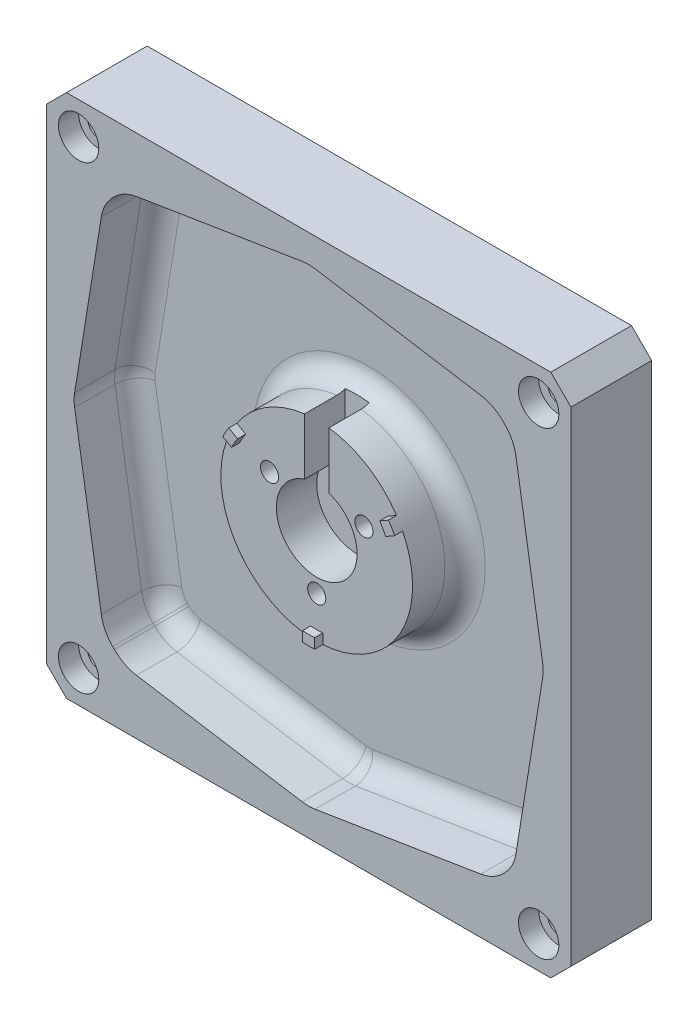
ISO-10303-21;
HEADER;
FILE_DESCRIPTION(('STEP AP214'),'2;1');
FILE_NAME('part.step','',(''),(''),'','','');
FILE_SCHEMA(('AUTOMOTIVE_DESIGN { 1 0 10303 214 1 1 1 1 }'));
ENDSEC;
DATA;
#1=APPLICATION_CONTEXT('core data for automotive mechanical design processes');
#2=APPLICATION_PROTOCOL_DEFINITION('international standard','automotive_design',2000,#1);
#3=PRODUCT_CONTEXT('',#1,'mechanical');
#4=PRODUCT('Part','Part','',(#3));
#5=PRODUCT_RELATED_PRODUCT_CATEGORY('part','',(#4));
#6=PRODUCT_DEFINITION_FORMATION('','',#4);
#7=PRODUCT_DEFINITION_CONTEXT('part definition',#1,'design');
#8=PRODUCT_DEFINITION('design','',#6,#7);
#9=PRODUCT_DEFINITION_SHAPE('','',#8);
#10=(LENGTH_UNIT() NAMED_UNIT(*) SI_UNIT(.MILLI.,.METRE.));
#11=(NAMED_UNIT(*) PLANE_ANGLE_UNIT() SI_UNIT($,.RADIAN.));
#12=(NAMED_UNIT(*) SI_UNIT($,.STERADIAN.) SOLID_ANGLE_UNIT());
#13=UNCERTAINTY_MEASURE_WITH_UNIT(LENGTH_MEASURE(1.E-05),#10,'distance_accuracy_value','');
#14=(GEOMETRIC_REPRESENTATION_CONTEXT(3) GLOBAL_UNCERTAINTY_ASSIGNED_CONTEXT((#13)) GLOBAL_UNIT_ASSIGNED_CONTEXT((#10,
#11,#12)) REPRESENTATION_CONTEXT('',''));
#15=CARTESIAN_POINT('',(0.,0.,0.));
#16=DIRECTION('',(0.,0.,1.));
#17=DIRECTION('',(1.,0.,0.));
#18=AXIS2_PLACEMENT_3D('',#15,#16,#17);
#19=CARTESIAN_POINT('',(0.,0.,8.));
#20=DIRECTION('',(0.,0.,1.));
#21=DIRECTION('',(1.,0.,0.));
#22=AXIS2_PLACEMENT_3D('',#19,#20,#21);
#23=PLANE('',#22);
#24=DIRECTION('',(0.,-1.,0.));
#25=VECTOR('',#24,1.);
#26=CARTESIAN_POINT('',(-3.,9.53939201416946,8.));
#27=LINE('',#26,#25);
#28=CARTESIAN_POINT('',(-3.,23.5597644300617,8.));
#29=VERTEX_POINT('',#28);
#30=CARTESIAN_POINT('',(-3.,9.53939201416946,8.));
#31=VERTEX_POINT('',#30);
#32=EDGE_CURVE('E431',#29,#31,#27,.T.);
#33=ORIENTED_EDGE('',*,*,#32,.F.);
#34=CARTESIAN_POINT('',(0.,0.,8.));
#35=DIRECTION('',(0.,0.,1.));
#36=DIRECTION('',(1.,0.,0.));
#37=AXIS2_PLACEMENT_3D('',#34,#35,#36);
#38=CIRCLE('',#37,23.75);
#39=CARTESIAN_POINT('',(-19.7770400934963,13.1503302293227,8.));
#40=VERTEX_POINT('',#39);
#41=EDGE_CURVE('E586',#29,#40,#38,.T.);
#42=ORIENTED_EDGE('',*,*,#41,.T.);
#43=DIRECTION('',(-0.866025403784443,0.499999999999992,0.));
#44=VECTOR('',#43,1.);
#45=CARTESIAN_POINT('',(-17.6071341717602,11.8975344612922,8.));
#46=LINE('',#45,#44);
#47=CARTESIAN_POINT('',(-17.6071341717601,11.8975344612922,8.));
#48=VERTEX_POINT('',#47);
#49=EDGE_CURVE('E451',#48,#40,#46,.T.);
#50=ORIENTED_EDGE('',*,*,#49,.F.);
#51=CARTESIAN_POINT('',(0.,0.,8.));
#52=DIRECTION('',(0.,0.,-1.));
#53=DIRECTION('',(-0.499999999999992,-0.866025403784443,0.));
#54=AXIS2_PLACEMENT_3D('',#51,#52,#53);
#55=CIRCLE('',#54,21.25);
#56=CARTESIAN_POINT('',(-19.1071341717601,9.2994582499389,8.));
#57=VERTEX_POINT('',#56);
#58=EDGE_CURVE('E456',#57,#48,#55,.T.);
#59=ORIENTED_EDGE('',*,*,#58,.F.);
#60=DIRECTION('',(0.866025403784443,-0.499999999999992,0.));
#61=VECTOR('',#60,1.);
#62=CARTESIAN_POINT('',(-19.1071341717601,9.2994582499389,8.));
#63=LINE('',#62,#61);
#64=CARTESIAN_POINT('',(-21.2770400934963,10.5522540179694,8.));
#65=VERTEX_POINT('',#64);
#66=EDGE_CURVE('E460',#65,#57,#63,.T.);
#67=ORIENTED_EDGE('',*,*,#66,.F.);
#68=CARTESIAN_POINT('',(-1.5,-23.7025842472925,8.));
#69=VERTEX_POINT('',#68);
#70=EDGE_CURVE('E581',#65,#69,#38,.T.);
#71=ORIENTED_EDGE('',*,*,#70,.T.);
#72=DIRECTION('',(0.,-1.,0.));
#73=VECTOR('',#72,1.);
#74=CARTESIAN_POINT('',(-1.5,-21.1969927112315,8.));
#75=LINE('',#74,#73);
#76=CARTESIAN_POINT('',(-1.5,-21.1969927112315,8.));
#77=VERTEX_POINT('',#76);
#78=EDGE_CURVE('E513',#77,#69,#75,.T.);
#79=ORIENTED_EDGE('',*,*,#78,.F.);
#80=CARTESIAN_POINT('',(0.,0.,8.));
#81=DIRECTION('',(0.,0.,-1.));
#82=DIRECTION('',(1.,0.,0.));
#83=AXIS2_PLACEMENT_3D('',#80,#81,#82);
#84=CIRCLE('',#83,21.25);
#85=CARTESIAN_POINT('',(1.5,-21.1969927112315,8.));
#86=VERTEX_POINT('',#85);
#87=EDGE_CURVE('E518',#86,#77,#84,.T.);
#88=ORIENTED_EDGE('',*,*,#87,.F.);
#89=DIRECTION('',(0.,1.,0.));
#90=VECTOR('',#89,1.);
#91=CARTESIAN_POINT('',(1.5,-21.1969927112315,8.));
#92=LINE('',#91,#90);
#93=CARTESIAN_POINT('',(1.5,-23.7025842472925,8.));
#94=VERTEX_POINT('',#93);
#95=EDGE_CURVE('E522',#94,#86,#92,.T.);
#96=ORIENTED_EDGE('',*,*,#95,.F.);
#97=CARTESIAN_POINT('',(21.2770400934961,10.5522540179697,8.));
#98=VERTEX_POINT('',#97);
#99=EDGE_CURVE('E582',#94,#98,#38,.T.);
#100=ORIENTED_EDGE('',*,*,#99,.T.);
#101=DIRECTION('',(0.866025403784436,0.500000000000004,0.));
#102=VECTOR('',#101,1.);
#103=CARTESIAN_POINT('',(19.10713417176,9.29945824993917,8.));
#104=LINE('',#103,#102);
#105=CARTESIAN_POINT('',(19.10713417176,9.29945824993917,8.));
#106=VERTEX_POINT('',#105);
#107=EDGE_CURVE('E484',#106,#98,#104,.T.);
#108=ORIENTED_EDGE('',*,*,#107,.F.);
#109=CARTESIAN_POINT('',(0.,0.,8.));
#110=DIRECTION('',(0.,0.,-1.));
#111=DIRECTION('',(-0.500000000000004,0.866025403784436,0.));
#112=AXIS2_PLACEMENT_3D('',#109,#110,#111);
#113=CIRCLE('',#112,21.25);
#114=CARTESIAN_POINT('',(17.60713417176,11.8975344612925,8.));
#115=VERTEX_POINT('',#114);
#116=EDGE_CURVE('E489',#115,#106,#113,.T.);
#117=ORIENTED_EDGE('',*,*,#116,.F.);
#118=DIRECTION('',(-0.866025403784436,-0.500000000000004,0.));
#119=VECTOR('',#118,1.);
#120=CARTESIAN_POINT('',(17.60713417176,11.8975344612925,8.));
#121=LINE('',#120,#119);
#122=CARTESIAN_POINT('',(19.7770400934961,13.150330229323,8.));
#123=VERTEX_POINT('',#122);
#124=EDGE_CURVE('E492',#123,#115,#121,.T.);
#125=ORIENTED_EDGE('',*,*,#124,.F.);
#126=CARTESIAN_POINT('',(3.,23.5597644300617,8.));
#127=VERTEX_POINT('',#126);
#128=EDGE_CURVE('E440',#123,#127,#38,.T.);
#129=ORIENTED_EDGE('',*,*,#128,.T.);
#130=DIRECTION('',(0.,1.,0.));
#131=VECTOR('',#130,1.);
#132=CARTESIAN_POINT('',(3.,23.5597644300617,8.));
#133=LINE('',#132,#131);
#134=CARTESIAN_POINT('',(3.,9.53939201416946,8.));
#135=VERTEX_POINT('',#134);
#136=EDGE_CURVE('E425',#135,#127,#133,.T.);
#137=ORIENTED_EDGE('',*,*,#136,.F.);
#138=CARTESIAN_POINT('',(0.,0.,8.));
#139=DIRECTION('',(0.,0.,1.));
#140=DIRECTION('',(1.,0.,0.));
#141=AXIS2_PLACEMENT_3D('',#138,#139,#140);
#142=CIRCLE('',#141,10.);
#143=EDGE_CURVE('E437',#31,#135,#142,.T.);
#144=ORIENTED_EDGE('',*,*,#143,.F.);
#145=EDGE_LOOP('',(#33,#42,#50,#59,#67,#71,#79,#88,#96,#100,#108,#117,#125,#129,#137,#144));
#146=FACE_BOUND('',#145,.T.);
#147=CARTESIAN_POINT('',(-11.69134295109,6.74999999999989,8.));
#148=DIRECTION('',(0.,0.,1.));
#149=DIRECTION('',(1.,0.,0.));
#150=AXIS2_PLACEMENT_3D('',#147,#148,#149);
#151=CIRCLE('',#150,2.25);
#152=CARTESIAN_POINT('',(-9.44134295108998,6.74999999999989,8.));
#153=VERTEX_POINT('',#152);
#154=EDGE_CURVE('E554',#153,#153,#151,.T.);
#155=ORIENTED_EDGE('',*,*,#154,.F.);
#156=EDGE_LOOP('',(#155));
#157=FACE_BOUND('',#156,.T.);
#158=CARTESIAN_POINT('',(11.6913429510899,6.75000000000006,8.));
#159=DIRECTION('',(0.,0.,1.));
#160=DIRECTION('',(1.,0.,0.));
#161=AXIS2_PLACEMENT_3D('',#158,#159,#160);
#162=CIRCLE('',#161,2.25);
#163=CARTESIAN_POINT('',(13.9413429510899,6.75000000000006,8.));
#164=VERTEX_POINT('',#163);
#165=EDGE_CURVE('E566',#164,#164,#162,.T.);
#166=ORIENTED_EDGE('',*,*,#165,.F.);
#167=EDGE_LOOP('',(#166));
#168=FACE_BOUND('',#167,.T.);
#169=CARTESIAN_POINT('',(0.,-13.5,8.));
#170=DIRECTION('',(0.,0.,1.));
#171=DIRECTION('',(1.,0.,0.));
#172=AXIS2_PLACEMENT_3D('',#169,#170,#171);
#173=CIRCLE('',#172,2.25);
#174=CARTESIAN_POINT('',(2.25,-13.5,8.));
#175=VERTEX_POINT('',#174);
#176=EDGE_CURVE('E578',#175,#175,#173,.T.);
#177=ORIENTED_EDGE('',*,*,#176,.F.);
#178=EDGE_LOOP('',(#177));
#179=FACE_BOUND('',#178,.T.);
#180=ADVANCED_FACE('F36',(#146,#157,#168,#179),#23,.T.);
#181=CARTESIAN_POINT('',(0.,0.,-5.));
#182=DIRECTION('',(0.,0.,1.));
#183=DIRECTION('',(1.,0.,0.));
#184=AXIS2_PLACEMENT_3D('',#181,#182,#183);
#185=CYLINDRICAL_SURFACE('',#184,23.75);
#186=DIRECTION('',(0.,0.,1.));
#187=VECTOR('',#186,1.);
#188=CARTESIAN_POINT('',(-3.,23.5597644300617,-17.4253485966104));
#189=LINE('',#188,#187);
#190=CARTESIAN_POINT('',(-3.,23.5597644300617,0.));
#191=VERTEX_POINT('',#190);
#192=EDGE_CURVE('E2174',#191,#29,#189,.T.);
#193=ORIENTED_EDGE('',*,*,#192,.F.);
#194=CARTESIAN_POINT('',(0.,0.,0.));
#195=DIRECTION('',(0.,0.,-1.));
#196=DIRECTION('',(-1.,0.,0.));
#197=AXIS2_PLACEMENT_3D('',#194,#195,#196);
#198=CIRCLE('',#197,23.75);
#199=CARTESIAN_POINT('',(3.,23.5597644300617,0.));
#200=VERTEX_POINT('',#199);
#201=EDGE_CURVE('E891',#191,#200,#198,.F.);
#202=ORIENTED_EDGE('',*,*,#201,.T.);
#203=DIRECTION('',(0.,0.,1.));
#204=VECTOR('',#203,1.);
#205=CARTESIAN_POINT('',(3.,23.5597644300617,-17.4253485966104));
#206=LINE('',#205,#204);
#207=EDGE_CURVE('E430',#200,#127,#206,.T.);
#208=ORIENTED_EDGE('',*,*,#207,.T.);
#209=ORIENTED_EDGE('',*,*,#128,.F.);
#210=DIRECTION('',(0.,0.,-1.));
#211=VECTOR('',#210,1.);
#212=CARTESIAN_POINT('',(19.7770400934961,13.150330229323,15.31953235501));
#213=LINE('',#212,#211);
#214=CARTESIAN_POINT('',(19.7770400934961,13.150330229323,10.));
#215=VERTEX_POINT('',#214);
#216=EDGE_CURVE('E495',#215,#123,#213,.T.);
#217=ORIENTED_EDGE('',*,*,#216,.F.);
#218=CARTESIAN_POINT('',(0.,0.,10.));
#219=DIRECTION('',(0.,0.,1.));
#220=DIRECTION('',(1.,0.,0.));
#221=AXIS2_PLACEMENT_3D('',#218,#219,#220);
#222=CIRCLE('',#221,23.75);
#223=CARTESIAN_POINT('',(21.2770400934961,10.5522540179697,10.));
#224=VERTEX_POINT('',#223);
#225=EDGE_CURVE('E503',#224,#215,#222,.T.);
#226=ORIENTED_EDGE('',*,*,#225,.F.);
#227=DIRECTION('',(0.,0.,-1.));
#228=VECTOR('',#227,1.);
#229=CARTESIAN_POINT('',(21.2770400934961,10.5522540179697,15.31953235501));
#230=LINE('',#229,#228);
#231=EDGE_CURVE('E467',#224,#98,#230,.T.);
#232=ORIENTED_EDGE('',*,*,#231,.T.);
#233=ORIENTED_EDGE('',*,*,#99,.F.);
#234=DIRECTION('',(0.,0.,-1.));
#235=VECTOR('',#234,1.);
#236=CARTESIAN_POINT('',(1.5,-23.7025842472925,13.9392697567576));
#237=LINE('',#236,#235);
#238=CARTESIAN_POINT('',(1.5,-23.7025842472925,10.));
#239=VERTEX_POINT('',#238);
#240=EDGE_CURVE('E525',#239,#94,#237,.T.);
#241=ORIENTED_EDGE('',*,*,#240,.F.);
#242=CARTESIAN_POINT('',(0.,0.,10.));
#243=DIRECTION('',(0.,0.,1.));
#244=DIRECTION('',(1.,0.,0.));
#245=AXIS2_PLACEMENT_3D('',#242,#243,#244);
#246=CIRCLE('',#245,23.75);
#247=CARTESIAN_POINT('',(-1.5,-23.7025842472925,10.));
#248=VERTEX_POINT('',#247);
#249=EDGE_CURVE('E533',#248,#239,#246,.T.);
#250=ORIENTED_EDGE('',*,*,#249,.F.);
#251=DIRECTION('',(0.,0.,-1.));
#252=VECTOR('',#251,1.);
#253=CARTESIAN_POINT('',(-1.5,-23.7025842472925,13.9392697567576));
#254=LINE('',#253,#252);
#255=EDGE_CURVE('E499',#248,#69,#254,.T.);
#256=ORIENTED_EDGE('',*,*,#255,.T.);
#257=ORIENTED_EDGE('',*,*,#70,.F.);
#258=DIRECTION('',(0.,0.,-1.));
#259=VECTOR('',#258,1.);
#260=CARTESIAN_POINT('',(-21.2770400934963,10.5522540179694,15.3195323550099));
#261=LINE('',#260,#259);
#262=CARTESIAN_POINT('',(-21.2770400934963,10.5522540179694,10.));
#263=VERTEX_POINT('',#262);
#264=EDGE_CURVE('E463',#263,#65,#261,.T.);
#265=ORIENTED_EDGE('',*,*,#264,.F.);
#266=CARTESIAN_POINT('',(0.,0.,10.));
#267=DIRECTION('',(0.,0.,1.));
#268=DIRECTION('',(1.,0.,0.));
#269=AXIS2_PLACEMENT_3D('',#266,#267,#268);
#270=CIRCLE('',#269,23.75);
#271=CARTESIAN_POINT('',(-19.7770400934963,13.1503302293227,10.));
#272=VERTEX_POINT('',#271);
#273=EDGE_CURVE('E471',#272,#263,#270,.T.);
#274=ORIENTED_EDGE('',*,*,#273,.F.);
#275=DIRECTION('',(0.,0.,-1.));
#276=VECTOR('',#275,1.);
#277=CARTESIAN_POINT('',(-19.7770400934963,13.1503302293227,15.3195323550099));
#278=LINE('',#277,#276);
#279=EDGE_CURVE('E447',#272,#40,#278,.T.);
#280=ORIENTED_EDGE('',*,*,#279,.T.);
#281=ORIENTED_EDGE('',*,*,#41,.F.);
#282=EDGE_LOOP('',(#193,#202,#208,#209,#217,#226,#232,#233,#241,#250,#256,#257,#265,#274,#280,#281));
#283=FACE_BOUND('',#282,.T.);
#284=ADVANCED_FACE('F1024',(#283),#185,.T.);
#285=CARTESIAN_POINT('',(65.,-65.,10.));
#286=DIRECTION('',(-1.,0.,0.));
#287=DIRECTION('',(0.,-1.,0.));
#288=AXIS2_PLACEMENT_3D('',#285,#286,#287);
#289=PLANE('',#288);
#290=DIRECTION('',(0.,1.,0.));
#291=VECTOR('',#290,1.);
#292=CARTESIAN_POINT('',(65.,-65.,10.));
#293=LINE('',#292,#291);
#294=CARTESIAN_POINT('',(65.,-60.,10.));
#295=VERTEX_POINT('',#294);
#296=CARTESIAN_POINT('',(65.,60.,10.));
#297=VERTEX_POINT('',#296);
#298=EDGE_CURVE('E671',#295,#297,#293,.T.);
#299=ORIENTED_EDGE('',*,*,#298,.F.);
#300=DIRECTION('',(0.,0.,-1.));
#301=VECTOR('',#300,1.);
#302=CARTESIAN_POINT('',(65.,-60.,10.));
#303=LINE('',#302,#301);
#304=CARTESIAN_POINT('',(65.,-60.,-10.));
#305=VERTEX_POINT('',#304);
#306=EDGE_CURVE('E722',#295,#305,#303,.T.);
#307=ORIENTED_EDGE('',*,*,#306,.T.);
#308=DIRECTION('',(0.,1.,0.));
#309=VECTOR('',#308,1.);
#310=CARTESIAN_POINT('',(65.,-65.,-10.));
#311=LINE('',#310,#309);
#312=CARTESIAN_POINT('',(65.,60.,-10.));
#313=VERTEX_POINT('',#312);
#314=EDGE_CURVE('E670',#305,#313,#311,.T.);
#315=ORIENTED_EDGE('',*,*,#314,.T.);
#316=DIRECTION('',(0.,0.,1.));
#317=VECTOR('',#316,1.);
#318=CARTESIAN_POINT('',(65.,60.,10.));
#319=LINE('',#318,#317);
#320=EDGE_CURVE('E720',#313,#297,#319,.T.);
#321=ORIENTED_EDGE('',*,*,#320,.T.);
#322=EDGE_LOOP('',(#299,#307,#315,#321));
#323=FACE_BOUND('',#322,.T.);
#324=ADVANCED_FACE('F1027',(#323),#289,.F.);
#325=CARTESIAN_POINT('',(65.,65.,10.));
#326=DIRECTION('',(0.,-1.,0.));
#327=DIRECTION('',(0.,0.,-1.));
#328=AXIS2_PLACEMENT_3D('',#325,#326,#327);
#329=PLANE('',#328);
#330=DIRECTION('',(-1.,0.,0.));
#331=VECTOR('',#330,1.);
#332=CARTESIAN_POINT('',(65.,65.,10.));
#333=LINE('',#332,#331);
#334=CARTESIAN_POINT('',(60.0000000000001,65.,10.));
#335=VERTEX_POINT('',#334);
#336=CARTESIAN_POINT('',(-60.,65.,10.));
#337=VERTEX_POINT('',#336);
#338=EDGE_CURVE('E674',#335,#337,#333,.T.);
#339=ORIENTED_EDGE('',*,*,#338,.F.);
#340=DIRECTION('',(0.,0.,-1.));
#341=VECTOR('',#340,1.);
#342=CARTESIAN_POINT('',(60.0000000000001,65.,10.));
#343=LINE('',#342,#341);
#344=CARTESIAN_POINT('',(60.0000000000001,65.,-10.));
#345=VERTEX_POINT('',#344);
#346=EDGE_CURVE('E727',#335,#345,#343,.T.);
#347=ORIENTED_EDGE('',*,*,#346,.T.);
#348=DIRECTION('',(-1.,0.,0.));
#349=VECTOR('',#348,1.);
#350=CARTESIAN_POINT('',(65.,65.,-10.));
#351=LINE('',#350,#349);
#352=CARTESIAN_POINT('',(-60.,65.,-10.));
#353=VERTEX_POINT('',#352);
#354=EDGE_CURVE('E687',#345,#353,#351,.T.);
#355=ORIENTED_EDGE('',*,*,#354,.T.);
#356=DIRECTION('',(0.,0.,1.));
#357=VECTOR('',#356,1.);
#358=CARTESIAN_POINT('',(-60.,65.,10.));
#359=LINE('',#358,#357);
#360=EDGE_CURVE('E725',#353,#337,#359,.T.);
#361=ORIENTED_EDGE('',*,*,#360,.T.);
#362=EDGE_LOOP('',(#339,#347,#355,#361));
#363=FACE_BOUND('',#362,.T.);
#364=ADVANCED_FACE('F1147',(#363),#329,.F.);
#365=CARTESIAN_POINT('',(-65.,65.,10.));
#366=DIRECTION('',(1.,0.,0.));
#367=DIRECTION('',(0.,1.,0.));
#368=AXIS2_PLACEMENT_3D('',#365,#366,#367);
#369=PLANE('',#368);
#370=DIRECTION('',(0.,-1.,0.));
#371=VECTOR('',#370,1.);
#372=CARTESIAN_POINT('',(-65.,65.,-10.));
#373=LINE('',#372,#371);
#374=CARTESIAN_POINT('',(-65.,60.,-10.));
#375=VERTEX_POINT('',#374);
#376=CARTESIAN_POINT('',(-65.,-60.,-10.));
#377=VERTEX_POINT('',#376);
#378=EDGE_CURVE('E690',#375,#377,#373,.T.);
#379=ORIENTED_EDGE('',*,*,#378,.T.);
#380=DIRECTION('',(0.,0.,1.));
#381=VECTOR('',#380,1.);
#382=CARTESIAN_POINT('',(-65.,-60.,10.));
#383=LINE('',#382,#381);
#384=CARTESIAN_POINT('',(-65.,-60.,10.));
#385=VERTEX_POINT('',#384);
#386=EDGE_CURVE('E710',#377,#385,#383,.T.);
#387=ORIENTED_EDGE('',*,*,#386,.T.);
#388=DIRECTION('',(0.,-1.,0.));
#389=VECTOR('',#388,1.);
#390=CARTESIAN_POINT('',(-65.,65.,10.));
#391=LINE('',#390,#389);
#392=CARTESIAN_POINT('',(-65.,60.,10.));
#393=VERTEX_POINT('',#392);
#394=EDGE_CURVE('E678',#393,#385,#391,.T.);
#395=ORIENTED_EDGE('',*,*,#394,.F.);
#396=DIRECTION('',(0.,0.,-1.));
#397=VECTOR('',#396,1.);
#398=CARTESIAN_POINT('',(-65.,60.,10.));
#399=LINE('',#398,#397);
#400=EDGE_CURVE('E707',#393,#375,#399,.T.);
#401=ORIENTED_EDGE('',*,*,#400,.T.);
#402=EDGE_LOOP('',(#379,#387,#395,#401));
#403=FACE_BOUND('',#402,.T.);
#404=ADVANCED_FACE('F1143',(#403),#369,.F.);
#405=CARTESIAN_POINT('',(-65.,-65.,10.));
#406=DIRECTION('',(0.,1.,0.));
#407=DIRECTION('',(0.,0.,1.));
#408=AXIS2_PLACEMENT_3D('',#405,#406,#407);
#409=PLANE('',#408);
#410=DIRECTION('',(1.,0.,0.));
#411=VECTOR('',#410,1.);
#412=CARTESIAN_POINT('',(-65.,-65.,10.));
#413=LINE('',#412,#411);
#414=CARTESIAN_POINT('',(-60.,-65.,10.));
#415=VERTEX_POINT('',#414);
#416=CARTESIAN_POINT('',(60.,-65.,10.));
#417=VERTEX_POINT('',#416);
#418=EDGE_CURVE('E681',#415,#417,#413,.T.);
#419=ORIENTED_EDGE('',*,*,#418,.F.);
#420=DIRECTION('',(0.,0.,-1.));
#421=VECTOR('',#420,1.);
#422=CARTESIAN_POINT('',(-60.,-65.,10.));
#423=LINE('',#422,#421);
#424=CARTESIAN_POINT('',(-60.,-65.,-10.));
#425=VERTEX_POINT('',#424);
#426=EDGE_CURVE('E696',#415,#425,#423,.T.);
#427=ORIENTED_EDGE('',*,*,#426,.T.);
#428=DIRECTION('',(1.,0.,0.));
#429=VECTOR('',#428,1.);
#430=CARTESIAN_POINT('',(-65.,-65.,-10.));
#431=LINE('',#430,#429);
#432=CARTESIAN_POINT('',(60.,-65.,-10.));
#433=VERTEX_POINT('',#432);
#434=EDGE_CURVE('E675',#425,#433,#431,.T.);
#435=ORIENTED_EDGE('',*,*,#434,.T.);
#436=DIRECTION('',(0.,0.,1.));
#437=VECTOR('',#436,1.);
#438=CARTESIAN_POINT('',(60.,-65.,10.));
#439=LINE('',#438,#437);
#440=EDGE_CURVE('E684',#433,#417,#439,.T.);
#441=ORIENTED_EDGE('',*,*,#440,.T.);
#442=EDGE_LOOP('',(#419,#427,#435,#441));
#443=FACE_BOUND('',#442,.T.);
#444=ADVANCED_FACE('F1136',(#443),#409,.F.);
#445=CARTESIAN_POINT('',(0.,0.,10.));
#446=DIRECTION('',(0.,0.,1.));
#447=DIRECTION('',(1.,0.,0.));
#448=AXIS2_PLACEMENT_3D('',#445,#446,#447);
#449=PLANE('',#448);
#450=DIRECTION('',(-0.987288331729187,-0.158939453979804,0.));
#451=VECTOR('',#450,1.);
#452=CARTESIAN_POINT('',(-45.8578643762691,50.857864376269,10.));
#453=LINE('',#452,#451);
#454=CARTESIAN_POINT('',(-1.58939453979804,57.9844617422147,10.));
#455=VERTEX_POINT('',#454);
#456=CARTESIAN_POINT('',(-42.6638088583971,51.3720621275,10.));
#457=VERTEX_POINT('',#456);
#458=EDGE_CURVE('E585',#455,#457,#453,.T.);
#459=ORIENTED_EDGE('',*,*,#458,.F.);
#460=CARTESIAN_POINT('',(0.,48.1115784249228,10.));
#461=DIRECTION('',(0.,0.,1.));
#462=DIRECTION('',(1.,0.,0.));
#463=AXIS2_PLACEMENT_3D('',#460,#461,#462);
#464=CIRCLE('',#463,10.);
#465=CARTESIAN_POINT('',(1.58939453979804,57.9844617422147,10.));
#466=VERTEX_POINT('',#465);
#467=EDGE_CURVE('E790',#455,#466,#464,.F.);
#468=ORIENTED_EDGE('',*,*,#467,.T.);
#469=DIRECTION('',(-0.987288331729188,0.158939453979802,0.));
#470=VECTOR('',#469,1.);
#471=CARTESIAN_POINT('',(0.,58.2403317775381,10.));
#472=LINE('',#471,#470);
#473=CARTESIAN_POINT('',(42.663808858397,51.3720621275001,10.));
#474=VERTEX_POINT('',#473);
#475=EDGE_CURVE('E619',#474,#466,#472,.T.);
#476=ORIENTED_EDGE('',*,*,#475,.F.);
#477=CARTESIAN_POINT('',(41.074414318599,41.4991788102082,10.));
#478=DIRECTION('',(0.,0.,1.));
#479=DIRECTION('',(1.,0.,0.));
#480=AXIS2_PLACEMENT_3D('',#477,#478,#479);
#481=CIRCLE('',#480,10.);
#482=CARTESIAN_POINT('',(48.1454821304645,48.5702466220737,10.));
#483=VERTEX_POINT('',#482);
#484=EDGE_CURVE('E792',#474,#483,#481,.F.);
#485=ORIENTED_EDGE('',*,*,#484,.T.);
#486=DIRECTION('',(-0.707106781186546,0.707106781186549,0.));
#487=VECTOR('',#486,1.);
#488=CARTESIAN_POINT('',(50.857864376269,45.8578643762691,10.));
#489=LINE('',#488,#487);
#490=CARTESIAN_POINT('',(48.5702466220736,48.1454821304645,10.));
#491=VERTEX_POINT('',#490);
#492=EDGE_CURVE('E616',#491,#483,#489,.T.);
#493=ORIENTED_EDGE('',*,*,#492,.F.);
#494=CARTESIAN_POINT('',(41.4991788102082,41.074414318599,10.));
#495=DIRECTION('',(0.,0.,1.));
#496=DIRECTION('',(1.,0.,0.));
#497=AXIS2_PLACEMENT_3D('',#494,#495,#496);
#498=CIRCLE('',#497,10.);
#499=CARTESIAN_POINT('',(51.3720621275,42.6638088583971,10.));
#500=VERTEX_POINT('',#499);
#501=EDGE_CURVE('E794',#491,#500,#498,.F.);
#502=ORIENTED_EDGE('',*,*,#501,.T.);
#503=DIRECTION('',(-0.158939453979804,0.987288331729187,0.));
#504=VECTOR('',#503,1.);
#505=CARTESIAN_POINT('',(50.857864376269,45.8578643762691,10.));
#506=LINE('',#505,#504);
#507=CARTESIAN_POINT('',(57.9844617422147,1.58939453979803,10.));
#508=VERTEX_POINT('',#507);
#509=EDGE_CURVE('E613',#508,#500,#506,.T.);
#510=ORIENTED_EDGE('',*,*,#509,.F.);
#511=CARTESIAN_POINT('',(48.1115784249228,0.,10.));
#512=DIRECTION('',(0.,0.,1.));
#513=DIRECTION('',(1.,0.,0.));
#514=AXIS2_PLACEMENT_3D('',#511,#512,#513);
#515=CIRCLE('',#514,10.);
#516=CARTESIAN_POINT('',(57.9844617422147,-1.58939453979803,10.));
#517=VERTEX_POINT('',#516);
#518=EDGE_CURVE('E796',#508,#517,#515,.F.);
#519=ORIENTED_EDGE('',*,*,#518,.T.);
#520=DIRECTION('',(0.158939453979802,0.987288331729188,0.));
#521=VECTOR('',#520,1.);
#522=CARTESIAN_POINT('',(58.2403317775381,0.,10.));
#523=LINE('',#522,#521);
#524=CARTESIAN_POINT('',(51.3720621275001,-42.663808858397,10.));
#525=VERTEX_POINT('',#524);
#526=EDGE_CURVE('E610',#525,#517,#523,.T.);
#527=ORIENTED_EDGE('',*,*,#526,.F.);
#528=CARTESIAN_POINT('',(41.4991788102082,-41.0744143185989,10.));
#529=DIRECTION('',(0.,0.,1.));
#530=DIRECTION('',(1.,0.,0.));
#531=AXIS2_PLACEMENT_3D('',#528,#529,#530);
#532=CIRCLE('',#531,10.);
#533=CARTESIAN_POINT('',(48.5702466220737,-48.1454821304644,10.));
#534=VERTEX_POINT('',#533);
#535=EDGE_CURVE('E798',#525,#534,#532,.F.);
#536=ORIENTED_EDGE('',*,*,#535,.T.);
#537=DIRECTION('',(0.707106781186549,0.707106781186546,0.));
#538=VECTOR('',#537,1.);
#539=CARTESIAN_POINT('',(45.8578643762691,-50.857864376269,10.));
#540=LINE('',#539,#538);
#541=CARTESIAN_POINT('',(48.1454821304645,-48.5702466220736,10.));
#542=VERTEX_POINT('',#541);
#543=EDGE_CURVE('E607',#542,#534,#540,.T.);
#544=ORIENTED_EDGE('',*,*,#543,.F.);
#545=CARTESIAN_POINT('',(41.074414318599,-41.4991788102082,10.));
#546=DIRECTION('',(0.,0.,1.));
#547=DIRECTION('',(1.,0.,0.));
#548=AXIS2_PLACEMENT_3D('',#545,#546,#547);
#549=CIRCLE('',#548,10.);
#550=CARTESIAN_POINT('',(42.6638088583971,-51.3720621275,10.));
#551=VERTEX_POINT('',#550);
#552=EDGE_CURVE('E800',#542,#551,#549,.F.);
#553=ORIENTED_EDGE('',*,*,#552,.T.);
#554=DIRECTION('',(0.987288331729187,0.158939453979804,0.));
#555=VECTOR('',#554,1.);
#556=CARTESIAN_POINT('',(45.8578643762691,-50.857864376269,10.));
#557=LINE('',#556,#555);
#558=CARTESIAN_POINT('',(1.58939453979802,-57.9844617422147,10.));
#559=VERTEX_POINT('',#558);
#560=EDGE_CURVE('E604',#559,#551,#557,.T.);
#561=ORIENTED_EDGE('',*,*,#560,.F.);
#562=CARTESIAN_POINT('',(0.,-48.1115784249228,10.));
#563=DIRECTION('',(0.,0.,1.));
#564=DIRECTION('',(1.,0.,0.));
#565=AXIS2_PLACEMENT_3D('',#562,#563,#564);
#566=CIRCLE('',#565,10.);
#567=CARTESIAN_POINT('',(-1.58939453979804,-57.9844617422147,10.));
#568=VERTEX_POINT('',#567);
#569=EDGE_CURVE('E802',#559,#568,#566,.F.);
#570=ORIENTED_EDGE('',*,*,#569,.T.);
#571=DIRECTION('',(0.987288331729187,-0.158939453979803,0.));
#572=VECTOR('',#571,1.);
#573=CARTESIAN_POINT('',(0.,-58.2403317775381,10.));
#574=LINE('',#573,#572);
#575=CARTESIAN_POINT('',(-42.663808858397,-51.3720621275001,10.));
#576=VERTEX_POINT('',#575);
#577=EDGE_CURVE('E601',#576,#568,#574,.T.);
#578=ORIENTED_EDGE('',*,*,#577,.F.);
#579=CARTESIAN_POINT('',(-41.074414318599,-41.4991788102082,10.));
#580=DIRECTION('',(0.,0.,1.));
#581=DIRECTION('',(1.,0.,0.));
#582=AXIS2_PLACEMENT_3D('',#579,#580,#581);
#583=CIRCLE('',#582,10.);
#584=CARTESIAN_POINT('',(-48.1454821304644,-48.5702466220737,10.));
#585=VERTEX_POINT('',#584);
#586=EDGE_CURVE('E804',#576,#585,#583,.F.);
#587=ORIENTED_EDGE('',*,*,#586,.T.);
#588=DIRECTION('',(0.707106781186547,-0.707106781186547,0.));
#589=VECTOR('',#588,1.);
#590=CARTESIAN_POINT('',(-50.8578643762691,-45.857864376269,10.));
#591=LINE('',#590,#589);
#592=CARTESIAN_POINT('',(-48.5702466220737,-48.1454821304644,10.));
#593=VERTEX_POINT('',#592);
#594=EDGE_CURVE('E598',#593,#585,#591,.T.);
#595=ORIENTED_EDGE('',*,*,#594,.F.);
#596=CARTESIAN_POINT('',(-41.4991788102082,-41.0744143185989,10.));
#597=DIRECTION('',(0.,0.,1.));
#598=DIRECTION('',(1.,0.,0.));
#599=AXIS2_PLACEMENT_3D('',#596,#597,#598);
#600=CIRCLE('',#599,10.);
#601=CARTESIAN_POINT('',(-51.3720621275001,-42.663808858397,10.));
#602=VERTEX_POINT('',#601);
#603=EDGE_CURVE('E806',#593,#602,#600,.F.);
#604=ORIENTED_EDGE('',*,*,#603,.T.);
#605=DIRECTION('',(0.158939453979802,-0.987288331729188,0.));
#606=VECTOR('',#605,1.);
#607=CARTESIAN_POINT('',(-58.2403317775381,0.,10.));
#608=LINE('',#607,#606);
#609=CARTESIAN_POINT('',(-57.9844617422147,-1.58939453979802,10.));
#610=VERTEX_POINT('',#609);
#611=EDGE_CURVE('E595',#610,#602,#608,.T.);
#612=ORIENTED_EDGE('',*,*,#611,.F.);
#613=CARTESIAN_POINT('',(-48.1115784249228,0.,10.));
#614=DIRECTION('',(0.,0.,1.));
#615=DIRECTION('',(1.,0.,0.));
#616=AXIS2_PLACEMENT_3D('',#613,#614,#615);
#617=CIRCLE('',#616,10.);
#618=CARTESIAN_POINT('',(-57.9844617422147,1.58939453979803,10.));
#619=VERTEX_POINT('',#618);
#620=EDGE_CURVE('E812',#610,#619,#617,.F.);
#621=ORIENTED_EDGE('',*,*,#620,.T.);
#622=DIRECTION('',(-0.158939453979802,-0.987288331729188,0.));
#623=VECTOR('',#622,1.);
#624=CARTESIAN_POINT('',(-50.8578643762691,45.857864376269,10.));
#625=LINE('',#624,#623);
#626=CARTESIAN_POINT('',(-51.3720621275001,42.663808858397,10.));
#627=VERTEX_POINT('',#626);
#628=EDGE_CURVE('E592',#627,#619,#625,.T.);
#629=ORIENTED_EDGE('',*,*,#628,.F.);
#630=CARTESIAN_POINT('',(-41.4991788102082,41.0744143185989,10.));
#631=DIRECTION('',(0.,0.,1.));
#632=DIRECTION('',(1.,0.,0.));
#633=AXIS2_PLACEMENT_3D('',#630,#631,#632);
#634=CIRCLE('',#633,10.);
#635=CARTESIAN_POINT('',(-48.5702466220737,48.1454821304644,10.));
#636=VERTEX_POINT('',#635);
#637=EDGE_CURVE('E808',#627,#636,#634,.F.);
#638=ORIENTED_EDGE('',*,*,#637,.T.);
#639=DIRECTION('',(-0.707106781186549,-0.707106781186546,0.));
#640=VECTOR('',#639,1.);
#641=CARTESIAN_POINT('',(-45.8578643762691,50.857864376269,10.));
#642=LINE('',#641,#640);
#643=CARTESIAN_POINT('',(-48.1454821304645,48.5702466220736,10.));
#644=VERTEX_POINT('',#643);
#645=EDGE_CURVE('E589',#644,#636,#642,.T.);
#646=ORIENTED_EDGE('',*,*,#645,.F.);
#647=CARTESIAN_POINT('',(-41.074414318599,41.4991788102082,10.));
#648=DIRECTION('',(0.,0.,1.));
#649=DIRECTION('',(1.,0.,0.));
#650=AXIS2_PLACEMENT_3D('',#647,#648,#649);
#651=CIRCLE('',#650,10.);
#652=EDGE_CURVE('E810',#644,#457,#651,.F.);
#653=ORIENTED_EDGE('',*,*,#652,.T.);
#654=EDGE_LOOP('',(#459,#468,#476,#485,#493,#502,#510,#519,#527,#536,#544,#553,#561,#570,#578,
#587,#595,#604,#612,#621,#629,#638,#646,#653));
#655=FACE_BOUND('',#654,.T.);
#656=CARTESIAN_POINT('',(-57.,57.,10.));
#657=DIRECTION('',(0.,0.,1.));
#658=DIRECTION('',(1.,0.,0.));
#659=AXIS2_PLACEMENT_3D('',#656,#657,#658);
#660=CIRCLE('',#659,5.);
#661=CARTESIAN_POINT('',(-52.,57.,10.));
#662=VERTEX_POINT('',#661);
#663=EDGE_CURVE('E622',#662,#662,#660,.T.);
#664=ORIENTED_EDGE('',*,*,#663,.F.);
#665=EDGE_LOOP('',(#664));
#666=FACE_BOUND('',#665,.T.);
#667=CARTESIAN_POINT('',(57.,57.,10.));
#668=DIRECTION('',(0.,0.,1.));
#669=DIRECTION('',(1.,0.,0.));
#670=AXIS2_PLACEMENT_3D('',#667,#668,#669);
#671=CIRCLE('',#670,5.);
#672=CARTESIAN_POINT('',(62.,57.,10.));
#673=VERTEX_POINT('',#672);
#674=EDGE_CURVE('E634',#673,#673,#671,.T.);
#675=ORIENTED_EDGE('',*,*,#674,.F.);
#676=EDGE_LOOP('',(#675));
#677=FACE_BOUND('',#676,.T.);
#678=CARTESIAN_POINT('',(57.,-57.,10.));
#679=DIRECTION('',(0.,0.,1.));
#680=DIRECTION('',(1.,0.,0.));
#681=AXIS2_PLACEMENT_3D('',#678,#679,#680);
#682=CIRCLE('',#681,5.);
#683=CARTESIAN_POINT('',(62.,-57.,10.));
#684=VERTEX_POINT('',#683);
#685=EDGE_CURVE('E646',#684,#684,#682,.T.);
#686=ORIENTED_EDGE('',*,*,#685,.F.);
#687=EDGE_LOOP('',(#686));
#688=FACE_BOUND('',#687,.T.);
#689=CARTESIAN_POINT('',(-57.,-57.,10.));
#690=DIRECTION('',(0.,0.,1.));
#691=DIRECTION('',(1.,0.,0.));
#692=AXIS2_PLACEMENT_3D('',#689,#690,#691);
#693=CIRCLE('',#692,5.);
#694=CARTESIAN_POINT('',(-52.,-57.,10.));
#695=VERTEX_POINT('',#694);
#696=EDGE_CURVE('E658',#695,#695,#693,.T.);
#697=ORIENTED_EDGE('',*,*,#696,.F.);
#698=EDGE_LOOP('',(#697));
#699=FACE_BOUND('',#698,.T.);
#700=ORIENTED_EDGE('',*,*,#394,.T.);
#701=DIRECTION('',(-0.707106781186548,0.707106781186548,0.));
#702=VECTOR('',#701,1.);
#703=CARTESIAN_POINT('',(-62.5,-62.5,10.));
#704=LINE('',#703,#702);
#705=EDGE_CURVE('E718',#385,#415,#704,.F.);
#706=ORIENTED_EDGE('',*,*,#705,.T.);
#707=ORIENTED_EDGE('',*,*,#418,.T.);
#708=DIRECTION('',(-0.707106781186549,-0.707106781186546,0.));
#709=VECTOR('',#708,1.);
#710=CARTESIAN_POINT('',(62.4999999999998,-62.5000000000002,10.));
#711=LINE('',#710,#709);
#712=EDGE_CURVE('E716',#417,#295,#711,.F.);
#713=ORIENTED_EDGE('',*,*,#712,.T.);
#714=ORIENTED_EDGE('',*,*,#298,.T.);
#715=DIRECTION('',(0.707106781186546,-0.707106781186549,0.));
#716=VECTOR('',#715,1.);
#717=CARTESIAN_POINT('',(62.5000000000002,62.4999999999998,10.));
#718=LINE('',#717,#716);
#719=EDGE_CURVE('E714',#297,#335,#718,.F.);
#720=ORIENTED_EDGE('',*,*,#719,.T.);
#721=ORIENTED_EDGE('',*,*,#338,.T.);
#722=DIRECTION('',(0.707106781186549,0.707106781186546,0.));
#723=VECTOR('',#722,1.);
#724=CARTESIAN_POINT('',(-62.4999999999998,62.5000000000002,10.));
#725=LINE('',#724,#723);
#726=EDGE_CURVE('E712',#337,#393,#725,.F.);
#727=ORIENTED_EDGE('',*,*,#726,.T.);
#728=EDGE_LOOP('',(#700,#706,#707,#713,#714,#720,#721,#727));
#729=FACE_BOUND('',#728,.T.);
#730=ADVANCED_FACE('F1133',(#655,#666,#677,#688,#699,#729),#449,.T.);
#731=CARTESIAN_POINT('',(0.,0.,-10.));
#732=DIRECTION('',(0.,0.,1.));
#733=DIRECTION('',(1.,0.,0.));
#734=AXIS2_PLACEMENT_3D('',#731,#732,#733);
#735=PLANE('',#734);
#736=CARTESIAN_POINT('',(-11.69134295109,6.74999999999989,-10.));
#737=DIRECTION('',(0.,0.,-1.));
#738=DIRECTION('',(-1.,0.,0.));
#739=AXIS2_PLACEMENT_3D('',#736,#737,#738);
#740=CIRCLE('',#739,3.99999999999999);
#741=CARTESIAN_POINT('',(-15.69134295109,6.74999999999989,-10.));
#742=VERTEX_POINT('',#741);
#743=EDGE_CURVE('E529',#742,#742,#740,.T.);
#744=ORIENTED_EDGE('',*,*,#743,.F.);
#745=EDGE_LOOP('',(#744));
#746=FACE_BOUND('',#745,.T.);
#747=CARTESIAN_POINT('',(11.6913429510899,6.75000000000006,-10.));
#748=DIRECTION('',(0.,0.,-1.));
#749=DIRECTION('',(-1.,0.,0.));
#750=AXIS2_PLACEMENT_3D('',#747,#748,#749);
#751=CIRCLE('',#750,3.99999999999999);
#752=CARTESIAN_POINT('',(7.6913429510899,6.75000000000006,-10.));
#753=VERTEX_POINT('',#752);
#754=EDGE_CURVE('E557',#753,#753,#751,.T.);
#755=ORIENTED_EDGE('',*,*,#754,.F.);
#756=EDGE_LOOP('',(#755));
#757=FACE_BOUND('',#756,.T.);
#758=CARTESIAN_POINT('',(0.,-13.5,-10.));
#759=DIRECTION('',(0.,0.,-1.));
#760=DIRECTION('',(-1.,0.,0.));
#761=AXIS2_PLACEMENT_3D('',#758,#759,#760);
#762=CIRCLE('',#761,3.99999999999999);
#763=CARTESIAN_POINT('',(-3.99999999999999,-13.5,-10.));
#764=VERTEX_POINT('',#763);
#765=EDGE_CURVE('E569',#764,#764,#762,.T.);
#766=ORIENTED_EDGE('',*,*,#765,.F.);
#767=EDGE_LOOP('',(#766));
#768=FACE_BOUND('',#767,.T.);
#769=CARTESIAN_POINT('',(-57.,57.,-10.));
#770=DIRECTION('',(0.,0.,1.));
#771=DIRECTION('',(1.,0.,0.));
#772=AXIS2_PLACEMENT_3D('',#769,#770,#771);
#773=CIRCLE('',#772,2.75);
#774=CARTESIAN_POINT('',(-54.25,57.,-10.));
#775=VERTEX_POINT('',#774);
#776=EDGE_CURVE('E631',#775,#775,#773,.T.);
#777=ORIENTED_EDGE('',*,*,#776,.T.);
#778=EDGE_LOOP('',(#777));
#779=FACE_BOUND('',#778,.T.);
#780=CARTESIAN_POINT('',(57.,57.,-10.));
#781=DIRECTION('',(0.,0.,1.));
#782=DIRECTION('',(1.,0.,0.));
#783=AXIS2_PLACEMENT_3D('',#780,#781,#782);
#784=CIRCLE('',#783,2.75);
#785=CARTESIAN_POINT('',(59.75,57.,-10.));
#786=VERTEX_POINT('',#785);
#787=EDGE_CURVE('E643',#786,#786,#784,.T.);
#788=ORIENTED_EDGE('',*,*,#787,.T.);
#789=EDGE_LOOP('',(#788));
#790=FACE_BOUND('',#789,.T.);
#791=CARTESIAN_POINT('',(57.,-57.,-10.));
#792=DIRECTION('',(0.,0.,1.));
#793=DIRECTION('',(1.,0.,0.));
#794=AXIS2_PLACEMENT_3D('',#791,#792,#793);
#795=CIRCLE('',#794,2.75);
#796=CARTESIAN_POINT('',(59.75,-57.,-10.));
#797=VERTEX_POINT('',#796);
#798=EDGE_CURVE('E655',#797,#797,#795,.T.);
#799=ORIENTED_EDGE('',*,*,#798,.T.);
#800=EDGE_LOOP('',(#799));
#801=FACE_BOUND('',#800,.T.);
#802=CARTESIAN_POINT('',(-57.,-57.,-10.));
#803=DIRECTION('',(0.,0.,1.));
#804=DIRECTION('',(1.,0.,0.));
#805=AXIS2_PLACEMENT_3D('',#802,#803,#804);
#806=CIRCLE('',#805,2.75);
#807=CARTESIAN_POINT('',(-54.25,-57.,-10.));
#808=VERTEX_POINT('',#807);
#809=EDGE_CURVE('E667',#808,#808,#806,.T.);
#810=ORIENTED_EDGE('',*,*,#809,.T.);
#811=EDGE_LOOP('',(#810));
#812=FACE_BOUND('',#811,.T.);
#813=ORIENTED_EDGE('',*,*,#434,.F.);
#814=DIRECTION('',(0.707106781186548,-0.707106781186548,0.));
#815=VECTOR('',#814,1.);
#816=CARTESIAN_POINT('',(-60.,-65.,-10.));
#817=LINE('',#816,#815);
#818=EDGE_CURVE('E705',#425,#377,#817,.F.);
#819=ORIENTED_EDGE('',*,*,#818,.T.);
#820=ORIENTED_EDGE('',*,*,#378,.F.);
#821=DIRECTION('',(-0.707106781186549,-0.707106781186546,0.));
#822=VECTOR('',#821,1.);
#823=CARTESIAN_POINT('',(-65.,60.,-10.));
#824=LINE('',#823,#822);
#825=EDGE_CURVE('E699',#375,#353,#824,.F.);
#826=ORIENTED_EDGE('',*,*,#825,.T.);
#827=ORIENTED_EDGE('',*,*,#354,.F.);
#828=DIRECTION('',(-0.707106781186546,0.707106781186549,0.));
#829=VECTOR('',#828,1.);
#830=CARTESIAN_POINT('',(60.0000000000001,65.,-10.));
#831=LINE('',#830,#829);
#832=EDGE_CURVE('E701',#345,#313,#831,.F.);
#833=ORIENTED_EDGE('',*,*,#832,.T.);
#834=ORIENTED_EDGE('',*,*,#314,.F.);
#835=DIRECTION('',(0.707106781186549,0.707106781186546,0.));
#836=VECTOR('',#835,1.);
#837=CARTESIAN_POINT('',(65.,-60.,-10.));
#838=LINE('',#837,#836);
#839=EDGE_CURVE('E703',#305,#433,#838,.F.);
#840=ORIENTED_EDGE('',*,*,#839,.T.);
#841=EDGE_LOOP('',(#813,#819,#820,#826,#827,#833,#834,#840));
#842=FACE_BOUND('',#841,.T.);
#843=ADVANCED_FACE('F1131',(#746,#757,#768,#779,#790,#801,#812,#842),#735,.F.);
#844=CARTESIAN_POINT('',(-57.,-57.,10.));
#845=DIRECTION('',(0.,0.,1.));
#846=DIRECTION('',(1.,0.,0.));
#847=AXIS2_PLACEMENT_3D('',#844,#845,#846);
#848=CYLINDRICAL_SURFACE('',#847,2.75);
#849=ORIENTED_EDGE('',*,*,#809,.F.);
#850=EDGE_LOOP('',(#849));
#851=FACE_BOUND('',#850,.T.);
#852=CARTESIAN_POINT('',(-57.,-57.,5.));
#853=DIRECTION('',(0.,0.,1.));
#854=DIRECTION('',(1.,0.,0.));
#855=AXIS2_PLACEMENT_3D('',#852,#853,#854);
#856=CIRCLE('',#855,2.75);
#857=CARTESIAN_POINT('',(-54.25,-57.,5.));
#858=VERTEX_POINT('',#857);
#859=EDGE_CURVE('E664',#858,#858,#856,.T.);
#860=ORIENTED_EDGE('',*,*,#859,.T.);
#861=EDGE_LOOP('',(#860));
#862=FACE_BOUND('',#861,.T.);
#863=ADVANCED_FACE('F1127',(#851,#862),#848,.F.);
#864=CARTESIAN_POINT('',(-54.25,-57.,5.));
#865=DIRECTION('',(0.,0.,-1.));
#866=DIRECTION('',(-1.,0.,0.));
#867=AXIS2_PLACEMENT_3D('',#864,#865,#866);
#868=PLANE('',#867);
#869=ORIENTED_EDGE('',*,*,#859,.F.);
#870=EDGE_LOOP('',(#869));
#871=FACE_BOUND('',#870,.T.);
#872=CARTESIAN_POINT('',(-57.,-57.,5.));
#873=DIRECTION('',(0.,0.,1.));
#874=DIRECTION('',(1.,0.,0.));
#875=AXIS2_PLACEMENT_3D('',#872,#873,#874);
#876=CIRCLE('',#875,5.);
#877=CARTESIAN_POINT('',(-52.,-57.,5.));
#878=VERTEX_POINT('',#877);
#879=EDGE_CURVE('E661',#878,#878,#876,.T.);
#880=ORIENTED_EDGE('',*,*,#879,.T.);
#881=EDGE_LOOP('',(#880));
#882=FACE_BOUND('',#881,.T.);
#883=ADVANCED_FACE('F1123',(#871,#882),#868,.F.);
#884=CARTESIAN_POINT('',(-57.,-57.,10.));
#885=DIRECTION('',(0.,0.,1.));
#886=DIRECTION('',(1.,0.,0.));
#887=AXIS2_PLACEMENT_3D('',#884,#885,#886);
#888=CYLINDRICAL_SURFACE('',#887,5.);
#889=ORIENTED_EDGE('',*,*,#879,.F.);
#890=EDGE_LOOP('',(#889));
#891=FACE_BOUND('',#890,.T.);
#892=ORIENTED_EDGE('',*,*,#696,.T.);
#893=EDGE_LOOP('',(#892));
#894=FACE_BOUND('',#893,.T.);
#895=ADVANCED_FACE('F1119',(#891,#894),#888,.F.);
#896=CARTESIAN_POINT('',(57.,-57.,10.));
#897=DIRECTION('',(0.,0.,1.));
#898=DIRECTION('',(1.,0.,0.));
#899=AXIS2_PLACEMENT_3D('',#896,#897,#898);
#900=CYLINDRICAL_SURFACE('',#899,2.75);
#901=ORIENTED_EDGE('',*,*,#798,.F.);
#902=EDGE_LOOP('',(#901));
#903=FACE_BOUND('',#902,.T.);
#904=CARTESIAN_POINT('',(57.,-57.,5.));
#905=DIRECTION('',(0.,0.,1.));
#906=DIRECTION('',(1.,0.,0.));
#907=AXIS2_PLACEMENT_3D('',#904,#905,#906);
#908=CIRCLE('',#907,2.75);
#909=CARTESIAN_POINT('',(59.75,-57.,5.));
#910=VERTEX_POINT('',#909);
#911=EDGE_CURVE('E652',#910,#910,#908,.T.);
#912=ORIENTED_EDGE('',*,*,#911,.T.);
#913=EDGE_LOOP('',(#912));
#914=FACE_BOUND('',#913,.T.);
#915=ADVANCED_FACE('F1115',(#903,#914),#900,.F.);
#916=CARTESIAN_POINT('',(59.75,-57.,5.));
#917=DIRECTION('',(0.,0.,-1.));
#918=DIRECTION('',(-1.,0.,0.));
#919=AXIS2_PLACEMENT_3D('',#916,#917,#918);
#920=PLANE('',#919);
#921=ORIENTED_EDGE('',*,*,#911,.F.);
#922=EDGE_LOOP('',(#921));
#923=FACE_BOUND('',#922,.T.);
#924=CARTESIAN_POINT('',(57.,-57.,5.));
#925=DIRECTION('',(0.,0.,1.));
#926=DIRECTION('',(1.,0.,0.));
#927=AXIS2_PLACEMENT_3D('',#924,#925,#926);
#928=CIRCLE('',#927,5.);
#929=CARTESIAN_POINT('',(62.,-57.,5.));
#930=VERTEX_POINT('',#929);
#931=EDGE_CURVE('E649',#930,#930,#928,.T.);
#932=ORIENTED_EDGE('',*,*,#931,.T.);
#933=EDGE_LOOP('',(#932));
#934=FACE_BOUND('',#933,.T.);
#935=ADVANCED_FACE('F1111',(#923,#934),#920,.F.);
#936=CARTESIAN_POINT('',(57.,-57.,10.));
#937=DIRECTION('',(0.,0.,1.));
#938=DIRECTION('',(1.,0.,0.));
#939=AXIS2_PLACEMENT_3D('',#936,#937,#938);
#940=CYLINDRICAL_SURFACE('',#939,5.);
#941=ORIENTED_EDGE('',*,*,#931,.F.);
#942=EDGE_LOOP('',(#941));
#943=FACE_BOUND('',#942,.T.);
#944=ORIENTED_EDGE('',*,*,#685,.T.);
#945=EDGE_LOOP('',(#944));
#946=FACE_BOUND('',#945,.T.);
#947=ADVANCED_FACE('F1107',(#943,#946),#940,.F.);
#948=CARTESIAN_POINT('',(57.,57.,10.));
#949=DIRECTION('',(0.,0.,1.));
#950=DIRECTION('',(1.,0.,0.));
#951=AXIS2_PLACEMENT_3D('',#948,#949,#950);
#952=CYLINDRICAL_SURFACE('',#951,2.75);
#953=ORIENTED_EDGE('',*,*,#787,.F.);
#954=EDGE_LOOP('',(#953));
#955=FACE_BOUND('',#954,.T.);
#956=CARTESIAN_POINT('',(57.,57.,5.));
#957=DIRECTION('',(0.,0.,1.));
#958=DIRECTION('',(1.,0.,0.));
#959=AXIS2_PLACEMENT_3D('',#956,#957,#958);
#960=CIRCLE('',#959,2.75);
#961=CARTESIAN_POINT('',(59.75,57.,5.));
#962=VERTEX_POINT('',#961);
#963=EDGE_CURVE('E640',#962,#962,#960,.T.);
#964=ORIENTED_EDGE('',*,*,#963,.T.);
#965=EDGE_LOOP('',(#964));
#966=FACE_BOUND('',#965,.T.);
#967=ADVANCED_FACE('F1103',(#955,#966),#952,.F.);
#968=CARTESIAN_POINT('',(59.75,57.,5.));
#969=DIRECTION('',(0.,0.,-1.));
#970=DIRECTION('',(-1.,0.,0.));
#971=AXIS2_PLACEMENT_3D('',#968,#969,#970);
#972=PLANE('',#971);
#973=ORIENTED_EDGE('',*,*,#963,.F.);
#974=EDGE_LOOP('',(#973));
#975=FACE_BOUND('',#974,.T.);
#976=CARTESIAN_POINT('',(57.,57.,5.));
#977=DIRECTION('',(0.,0.,1.));
#978=DIRECTION('',(1.,0.,0.));
#979=AXIS2_PLACEMENT_3D('',#976,#977,#978);
#980=CIRCLE('',#979,5.);
#981=CARTESIAN_POINT('',(62.,57.,5.));
#982=VERTEX_POINT('',#981);
#983=EDGE_CURVE('E637',#982,#982,#980,.T.);
#984=ORIENTED_EDGE('',*,*,#983,.T.);
#985=EDGE_LOOP('',(#984));
#986=FACE_BOUND('',#985,.T.);
#987=ADVANCED_FACE('F1099',(#975,#986),#972,.F.);
#988=CARTESIAN_POINT('',(57.,57.,10.));
#989=DIRECTION('',(0.,0.,1.));
#990=DIRECTION('',(1.,0.,0.));
#991=AXIS2_PLACEMENT_3D('',#988,#989,#990);
#992=CYLINDRICAL_SURFACE('',#991,5.);
#993=ORIENTED_EDGE('',*,*,#983,.F.);
#994=EDGE_LOOP('',(#993));
#995=FACE_BOUND('',#994,.T.);
#996=ORIENTED_EDGE('',*,*,#674,.T.);
#997=EDGE_LOOP('',(#996));
#998=FACE_BOUND('',#997,.T.);
#999=ADVANCED_FACE('F1095',(#995,#998),#992,.F.);
#1000=CARTESIAN_POINT('',(-57.,57.,10.));
#1001=DIRECTION('',(0.,0.,1.));
#1002=DIRECTION('',(1.,0.,0.));
#1003=AXIS2_PLACEMENT_3D('',#1000,#1001,#1002);
#1004=CYLINDRICAL_SURFACE('',#1003,2.75);
#1005=ORIENTED_EDGE('',*,*,#776,.F.);
#1006=EDGE_LOOP('',(#1005));
#1007=FACE_BOUND('',#1006,.T.);
#1008=CARTESIAN_POINT('',(-57.,57.,5.));
#1009=DIRECTION('',(0.,0.,1.));
#1010=DIRECTION('',(1.,0.,0.));
#1011=AXIS2_PLACEMENT_3D('',#1008,#1009,#1010);
#1012=CIRCLE('',#1011,2.75);
#1013=CARTESIAN_POINT('',(-54.25,57.,5.));
#1014=VERTEX_POINT('',#1013);
#1015=EDGE_CURVE('E628',#1014,#1014,#1012,.T.);
#1016=ORIENTED_EDGE('',*,*,#1015,.T.);
#1017=EDGE_LOOP('',(#1016));
#1018=FACE_BOUND('',#1017,.T.);
#1019=ADVANCED_FACE('F1091',(#1007,#1018),#1004,.F.);
#1020=CARTESIAN_POINT('',(-54.25,57.,5.));
#1021=DIRECTION('',(0.,0.,-1.));
#1022=DIRECTION('',(-1.,0.,0.));
#1023=AXIS2_PLACEMENT_3D('',#1020,#1021,#1022);
#1024=PLANE('',#1023);
#1025=ORIENTED_EDGE('',*,*,#1015,.F.);
#1026=EDGE_LOOP('',(#1025));
#1027=FACE_BOUND('',#1026,.T.);
#1028=CARTESIAN_POINT('',(-57.,57.,5.));
#1029=DIRECTION('',(0.,0.,1.));
#1030=DIRECTION('',(1.,0.,0.));
#1031=AXIS2_PLACEMENT_3D('',#1028,#1029,#1030);
#1032=CIRCLE('',#1031,5.);
#1033=CARTESIAN_POINT('',(-52.,57.,5.));
#1034=VERTEX_POINT('',#1033);
#1035=EDGE_CURVE('E625',#1034,#1034,#1032,.T.);
#1036=ORIENTED_EDGE('',*,*,#1035,.T.);
#1037=EDGE_LOOP('',(#1036));
#1038=FACE_BOUND('',#1037,.T.);
#1039=ADVANCED_FACE('F1087',(#1027,#1038),#1024,.F.);
#1040=CARTESIAN_POINT('',(-57.,57.,10.));
#1041=DIRECTION('',(0.,0.,1.));
#1042=DIRECTION('',(1.,0.,0.));
#1043=AXIS2_PLACEMENT_3D('',#1040,#1041,#1042);
#1044=CYLINDRICAL_SURFACE('',#1043,5.);
#1045=ORIENTED_EDGE('',*,*,#1035,.F.);
#1046=EDGE_LOOP('',(#1045));
#1047=FACE_BOUND('',#1046,.T.);
#1048=ORIENTED_EDGE('',*,*,#663,.T.);
#1049=EDGE_LOOP('',(#1048));
#1050=FACE_BOUND('',#1049,.T.);
#1051=ADVANCED_FACE('F1083',(#1047,#1050),#1044,.F.);
#1052=CARTESIAN_POINT('',(-60.,-65.,10.));
#1053=DIRECTION('',(0.707106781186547,0.707106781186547,0.));
#1054=DIRECTION('',(0.,0.,-1.));
#1055=AXIS2_PLACEMENT_3D('',#1052,#1053,#1054);
#1056=PLANE('',#1055);
#1057=ORIENTED_EDGE('',*,*,#705,.F.);
#1058=ORIENTED_EDGE('',*,*,#386,.F.);
#1059=ORIENTED_EDGE('',*,*,#818,.F.);
#1060=ORIENTED_EDGE('',*,*,#426,.F.);
#1061=EDGE_LOOP('',(#1057,#1058,#1059,#1060));
#1062=FACE_BOUND('',#1061,.T.);
#1063=ADVANCED_FACE('F1086',(#1062),#1056,.F.);
#1064=CARTESIAN_POINT('',(65.,-60.,10.));
#1065=DIRECTION('',(-0.707106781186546,0.707106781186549,0.));
#1066=DIRECTION('',(0.,0.,-1.));
#1067=AXIS2_PLACEMENT_3D('',#1064,#1065,#1066);
#1068=PLANE('',#1067);
#1069=ORIENTED_EDGE('',*,*,#712,.F.);
#1070=ORIENTED_EDGE('',*,*,#440,.F.);
#1071=ORIENTED_EDGE('',*,*,#839,.F.);
#1072=ORIENTED_EDGE('',*,*,#306,.F.);
#1073=EDGE_LOOP('',(#1069,#1070,#1071,#1072));
#1074=FACE_BOUND('',#1073,.T.);
#1075=ADVANCED_FACE('F1157',(#1074),#1068,.F.);
#1076=CARTESIAN_POINT('',(60.0000000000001,65.,10.));
#1077=DIRECTION('',(-0.707106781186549,-0.707106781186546,0.));
#1078=DIRECTION('',(0.,0.,-1.));
#1079=AXIS2_PLACEMENT_3D('',#1076,#1077,#1078);
#1080=PLANE('',#1079);
#1081=ORIENTED_EDGE('',*,*,#719,.F.);
#1082=ORIENTED_EDGE('',*,*,#320,.F.);
#1083=ORIENTED_EDGE('',*,*,#832,.F.);
#1084=ORIENTED_EDGE('',*,*,#346,.F.);
#1085=EDGE_LOOP('',(#1081,#1082,#1083,#1084));
#1086=FACE_BOUND('',#1085,.T.);
#1087=ADVANCED_FACE('F1161',(#1086),#1080,.F.);
#1088=CARTESIAN_POINT('',(-65.,60.,10.));
#1089=DIRECTION('',(0.707106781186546,-0.707106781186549,0.));
#1090=DIRECTION('',(0.,0.,-1.));
#1091=AXIS2_PLACEMENT_3D('',#1088,#1089,#1090);
#1092=PLANE('',#1091);
#1093=ORIENTED_EDGE('',*,*,#726,.F.);
#1094=ORIENTED_EDGE('',*,*,#360,.F.);
#1095=ORIENTED_EDGE('',*,*,#825,.F.);
#1096=ORIENTED_EDGE('',*,*,#400,.F.);
#1097=EDGE_LOOP('',(#1093,#1094,#1095,#1096));
#1098=FACE_BOUND('',#1097,.T.);
#1099=ADVANCED_FACE('F1081',(#1098),#1092,.F.);
#1100=CARTESIAN_POINT('',(-45.8578643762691,50.857864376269,-5.));
#1101=DIRECTION('',(-0.158939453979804,0.987288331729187,0.));
#1102=DIRECTION('',(-0.987288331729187,-0.158939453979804,0.));
#1103=AXIS2_PLACEMENT_3D('',#1100,#1101,#1102);
#1104=PLANE('',#1103);
#1105=DIRECTION('',(0.,0.,1.));
#1106=VECTOR('',#1105,1.);
#1107=CARTESIAN_POINT('',(-42.6638088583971,51.3720621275,-5.));
#1108=LINE('',#1107,#1106);
#1109=CARTESIAN_POINT('',(-42.6638088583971,51.3720621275,0.));
#1110=VERTEX_POINT('',#1109);
#1111=EDGE_CURVE('E730',#457,#1110,#1108,.F.);
#1112=ORIENTED_EDGE('',*,*,#1111,.T.);
#1113=DIRECTION('',(-0.987288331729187,-0.158939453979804,0.));
#1114=VECTOR('',#1113,1.);
#1115=CARTESIAN_POINT('',(-1.58939453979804,57.9844617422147,0.));
#1116=LINE('',#1115,#1114);
#1117=CARTESIAN_POINT('',(-1.58939453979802,57.9844617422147,0.));
#1118=VERTEX_POINT('',#1117);
#1119=EDGE_CURVE('E894',#1110,#1118,#1116,.F.);
#1120=ORIENTED_EDGE('',*,*,#1119,.T.);
#1121=DIRECTION('',(0.,0.,1.));
#1122=VECTOR('',#1121,1.);
#1123=CARTESIAN_POINT('',(-1.58939453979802,57.9844617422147,10.));
#1124=LINE('',#1123,#1122);
#1125=EDGE_CURVE('E733',#1118,#455,#1124,.T.);
#1126=ORIENTED_EDGE('',*,*,#1125,.T.);
#1127=ORIENTED_EDGE('',*,*,#458,.T.);
#1128=EDGE_LOOP('',(#1112,#1120,#1126,#1127));
#1129=FACE_BOUND('',#1128,.T.);
#1130=ADVANCED_FACE('F1039',(#1129),#1104,.F.);
#1131=CARTESIAN_POINT('',(0.,58.2403317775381,-5.));
#1132=DIRECTION('',(0.158939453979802,0.987288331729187,0.));
#1133=DIRECTION('',(-0.987288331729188,0.158939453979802,0.));
#1134=AXIS2_PLACEMENT_3D('',#1131,#1132,#1133);
#1135=PLANE('',#1134);
#1136=DIRECTION('',(0.,0.,1.));
#1137=VECTOR('',#1136,1.);
#1138=CARTESIAN_POINT('',(1.58939453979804,57.9844617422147,-5.));
#1139=LINE('',#1138,#1137);
#1140=CARTESIAN_POINT('',(1.58939453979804,57.9844617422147,0.));
#1141=VERTEX_POINT('',#1140);
#1142=EDGE_CURVE('E737',#466,#1141,#1139,.F.);
#1143=ORIENTED_EDGE('',*,*,#1142,.T.);
#1144=DIRECTION('',(-0.987288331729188,0.158939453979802,0.));
#1145=VECTOR('',#1144,1.);
#1146=CARTESIAN_POINT('',(42.663808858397,51.3720621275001,0.));
#1147=LINE('',#1146,#1145);
#1148=CARTESIAN_POINT('',(42.663808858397,51.3720621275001,0.));
#1149=VERTEX_POINT('',#1148);
#1150=EDGE_CURVE('E914',#1141,#1149,#1147,.F.);
#1151=ORIENTED_EDGE('',*,*,#1150,.T.);
#1152=DIRECTION('',(0.,0.,1.));
#1153=VECTOR('',#1152,1.);
#1154=CARTESIAN_POINT('',(42.663808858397,51.3720621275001,10.));
#1155=LINE('',#1154,#1153);
#1156=EDGE_CURVE('E735',#1149,#474,#1155,.T.);
#1157=ORIENTED_EDGE('',*,*,#1156,.T.);
#1158=ORIENTED_EDGE('',*,*,#475,.T.);
#1159=EDGE_LOOP('',(#1143,#1151,#1157,#1158));
#1160=FACE_BOUND('',#1159,.T.);
#1161=ADVANCED_FACE('F1035',(#1160),#1135,.F.);
#1162=CARTESIAN_POINT('',(50.857864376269,45.8578643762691,-5.));
#1163=DIRECTION('',(0.707106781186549,0.707106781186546,0.));
#1164=DIRECTION('',(-0.707106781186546,0.707106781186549,0.));
#1165=AXIS2_PLACEMENT_3D('',#1162,#1163,#1164);
#1166=PLANE('',#1165);
#1167=DIRECTION('',(0.,0.,1.));
#1168=VECTOR('',#1167,1.);
#1169=CARTESIAN_POINT('',(48.1454821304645,48.5702466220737,-5.));
#1170=LINE('',#1169,#1168);
#1171=CARTESIAN_POINT('',(48.1454821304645,48.5702466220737,0.));
#1172=VERTEX_POINT('',#1171);
#1173=EDGE_CURVE('E742',#483,#1172,#1170,.F.);
#1174=ORIENTED_EDGE('',*,*,#1173,.T.);
#1175=DIRECTION('',(-0.707106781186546,0.707106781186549,0.));
#1176=VECTOR('',#1175,1.);
#1177=CARTESIAN_POINT('',(48.5702466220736,48.1454821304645,0.));
#1178=LINE('',#1177,#1176);
#1179=CARTESIAN_POINT('',(48.5702466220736,48.1454821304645,0.));
#1180=VERTEX_POINT('',#1179);
#1181=EDGE_CURVE('E912',#1172,#1180,#1178,.F.);
#1182=ORIENTED_EDGE('',*,*,#1181,.T.);
#1183=DIRECTION('',(0.,0.,1.));
#1184=VECTOR('',#1183,1.);
#1185=CARTESIAN_POINT('',(48.5702466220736,48.1454821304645,10.));
#1186=LINE('',#1185,#1184);
#1187=EDGE_CURVE('E740',#1180,#491,#1186,.T.);
#1188=ORIENTED_EDGE('',*,*,#1187,.T.);
#1189=ORIENTED_EDGE('',*,*,#492,.T.);
#1190=EDGE_LOOP('',(#1174,#1182,#1188,#1189));
#1191=FACE_BOUND('',#1190,.T.);
#1192=ADVANCED_FACE('F1038',(#1191),#1166,.F.);
#1193=CARTESIAN_POINT('',(50.857864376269,45.8578643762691,-5.));
#1194=DIRECTION('',(0.987288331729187,0.158939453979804,0.));
#1195=DIRECTION('',(-0.158939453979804,0.987288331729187,0.));
#1196=AXIS2_PLACEMENT_3D('',#1193,#1194,#1195);
#1197=PLANE('',#1196);
#1198=DIRECTION('',(0.,0.,1.));
#1199=VECTOR('',#1198,1.);
#1200=CARTESIAN_POINT('',(51.3720621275,42.6638088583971,-5.));
#1201=LINE('',#1200,#1199);
#1202=CARTESIAN_POINT('',(51.3720621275,42.6638088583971,0.));
#1203=VERTEX_POINT('',#1202);
#1204=EDGE_CURVE('E747',#500,#1203,#1201,.F.);
#1205=ORIENTED_EDGE('',*,*,#1204,.T.);
#1206=DIRECTION('',(-0.158939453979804,0.987288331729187,0.));
#1207=VECTOR('',#1206,1.);
#1208=CARTESIAN_POINT('',(57.9844617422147,1.58939453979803,0.));
#1209=LINE('',#1208,#1207);
#1210=CARTESIAN_POINT('',(57.9844617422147,1.58939453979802,0.));
#1211=VERTEX_POINT('',#1210);
#1212=EDGE_CURVE('E910',#1203,#1211,#1209,.F.);
#1213=ORIENTED_EDGE('',*,*,#1212,.T.);
#1214=DIRECTION('',(0.,0.,1.));
#1215=VECTOR('',#1214,1.);
#1216=CARTESIAN_POINT('',(57.9844617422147,1.58939453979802,10.));
#1217=LINE('',#1216,#1215);
#1218=EDGE_CURVE('E745',#1211,#508,#1217,.T.);
#1219=ORIENTED_EDGE('',*,*,#1218,.T.);
#1220=ORIENTED_EDGE('',*,*,#509,.T.);
#1221=EDGE_LOOP('',(#1205,#1213,#1219,#1220));
#1222=FACE_BOUND('',#1221,.T.);
#1223=ADVANCED_FACE('F1043',(#1222),#1197,.F.);
#1224=CARTESIAN_POINT('',(58.2403317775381,0.,-5.));
#1225=DIRECTION('',(0.987288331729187,-0.158939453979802,0.));
#1226=DIRECTION('',(0.158939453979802,0.987288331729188,0.));
#1227=AXIS2_PLACEMENT_3D('',#1224,#1225,#1226);
#1228=PLANE('',#1227);
#1229=DIRECTION('',(0.,0.,1.));
#1230=VECTOR('',#1229,1.);
#1231=CARTESIAN_POINT('',(57.9844617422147,-1.58939453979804,-5.));
#1232=LINE('',#1231,#1230);
#1233=CARTESIAN_POINT('',(57.9844617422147,-1.58939453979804,0.));
#1234=VERTEX_POINT('',#1233);
#1235=EDGE_CURVE('E752',#517,#1234,#1232,.F.);
#1236=ORIENTED_EDGE('',*,*,#1235,.T.);
#1237=DIRECTION('',(0.158939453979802,0.987288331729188,0.));
#1238=VECTOR('',#1237,1.);
#1239=CARTESIAN_POINT('',(51.3720621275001,-42.663808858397,0.));
#1240=LINE('',#1239,#1238);
#1241=CARTESIAN_POINT('',(51.3720621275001,-42.663808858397,0.));
#1242=VERTEX_POINT('',#1241);
#1243=EDGE_CURVE('E908',#1234,#1242,#1240,.F.);
#1244=ORIENTED_EDGE('',*,*,#1243,.T.);
#1245=DIRECTION('',(0.,0.,1.));
#1246=VECTOR('',#1245,1.);
#1247=CARTESIAN_POINT('',(51.3720621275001,-42.663808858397,10.));
#1248=LINE('',#1247,#1246);
#1249=EDGE_CURVE('E750',#1242,#525,#1248,.T.);
#1250=ORIENTED_EDGE('',*,*,#1249,.T.);
#1251=ORIENTED_EDGE('',*,*,#526,.T.);
#1252=EDGE_LOOP('',(#1236,#1244,#1250,#1251));
#1253=FACE_BOUND('',#1252,.T.);
#1254=ADVANCED_FACE('F1047',(#1253),#1228,.F.);
#1255=CARTESIAN_POINT('',(45.8578643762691,-50.857864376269,-5.));
#1256=DIRECTION('',(0.707106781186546,-0.707106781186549,0.));
#1257=DIRECTION('',(0.707106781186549,0.707106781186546,0.));
#1258=AXIS2_PLACEMENT_3D('',#1255,#1256,#1257);
#1259=PLANE('',#1258);
#1260=DIRECTION('',(0.,0.,1.));
#1261=VECTOR('',#1260,1.);
#1262=CARTESIAN_POINT('',(48.5702466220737,-48.1454821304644,-5.));
#1263=LINE('',#1262,#1261);
#1264=CARTESIAN_POINT('',(48.5702466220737,-48.1454821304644,0.));
#1265=VERTEX_POINT('',#1264);
#1266=EDGE_CURVE('E757',#534,#1265,#1263,.F.);
#1267=ORIENTED_EDGE('',*,*,#1266,.T.);
#1268=DIRECTION('',(0.707106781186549,0.707106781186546,0.));
#1269=VECTOR('',#1268,1.);
#1270=CARTESIAN_POINT('',(48.1454821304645,-48.5702466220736,0.));
#1271=LINE('',#1270,#1269);
#1272=CARTESIAN_POINT('',(48.1454821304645,-48.5702466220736,0.));
#1273=VERTEX_POINT('',#1272);
#1274=EDGE_CURVE('E906',#1265,#1273,#1271,.F.);
#1275=ORIENTED_EDGE('',*,*,#1274,.T.);
#1276=DIRECTION('',(0.,0.,1.));
#1277=VECTOR('',#1276,1.);
#1278=CARTESIAN_POINT('',(48.1454821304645,-48.5702466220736,10.));
#1279=LINE('',#1278,#1277);
#1280=EDGE_CURVE('E755',#1273,#542,#1279,.T.);
#1281=ORIENTED_EDGE('',*,*,#1280,.T.);
#1282=ORIENTED_EDGE('',*,*,#543,.T.);
#1283=EDGE_LOOP('',(#1267,#1275,#1281,#1282));
#1284=FACE_BOUND('',#1283,.T.);
#1285=ADVANCED_FACE('F1051',(#1284),#1259,.F.);
#1286=CARTESIAN_POINT('',(45.8578643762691,-50.857864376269,-5.));
#1287=DIRECTION('',(0.158939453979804,-0.987288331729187,0.));
#1288=DIRECTION('',(0.987288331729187,0.158939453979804,0.));
#1289=AXIS2_PLACEMENT_3D('',#1286,#1287,#1288);
#1290=PLANE('',#1289);
#1291=DIRECTION('',(0.,0.,1.));
#1292=VECTOR('',#1291,1.);
#1293=CARTESIAN_POINT('',(42.6638088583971,-51.3720621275,-5.));
#1294=LINE('',#1293,#1292);
#1295=CARTESIAN_POINT('',(42.6638088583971,-51.3720621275,0.));
#1296=VERTEX_POINT('',#1295);
#1297=EDGE_CURVE('E762',#551,#1296,#1294,.F.);
#1298=ORIENTED_EDGE('',*,*,#1297,.T.);
#1299=DIRECTION('',(0.987288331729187,0.158939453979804,0.));
#1300=VECTOR('',#1299,1.);
#1301=CARTESIAN_POINT('',(1.58939453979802,-57.9844617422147,0.));
#1302=LINE('',#1301,#1300);
#1303=CARTESIAN_POINT('',(1.58939453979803,-57.9844617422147,0.));
#1304=VERTEX_POINT('',#1303);
#1305=EDGE_CURVE('E904',#1296,#1304,#1302,.F.);
#1306=ORIENTED_EDGE('',*,*,#1305,.T.);
#1307=DIRECTION('',(0.,0.,1.));
#1308=VECTOR('',#1307,1.);
#1309=CARTESIAN_POINT('',(1.58939453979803,-57.9844617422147,10.));
#1310=LINE('',#1309,#1308);
#1311=EDGE_CURVE('E760',#1304,#559,#1310,.T.);
#1312=ORIENTED_EDGE('',*,*,#1311,.T.);
#1313=ORIENTED_EDGE('',*,*,#560,.T.);
#1314=EDGE_LOOP('',(#1298,#1306,#1312,#1313));
#1315=FACE_BOUND('',#1314,.T.);
#1316=ADVANCED_FACE('F1055',(#1315),#1290,.F.);
#1317=CARTESIAN_POINT('',(0.,-58.2403317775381,-5.));
#1318=DIRECTION('',(-0.158939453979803,-0.987288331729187,0.));
#1319=DIRECTION('',(0.987288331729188,-0.158939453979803,0.));
#1320=AXIS2_PLACEMENT_3D('',#1317,#1318,#1319);
#1321=PLANE('',#1320);
#1322=DIRECTION('',(0.,0.,1.));
#1323=VECTOR('',#1322,1.);
#1324=CARTESIAN_POINT('',(-1.58939453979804,-57.9844617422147,-5.));
#1325=LINE('',#1324,#1323);
#1326=CARTESIAN_POINT('',(-1.58939453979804,-57.9844617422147,0.));
#1327=VERTEX_POINT('',#1326);
#1328=EDGE_CURVE('E767',#568,#1327,#1325,.F.);
#1329=ORIENTED_EDGE('',*,*,#1328,.T.);
#1330=DIRECTION('',(0.987288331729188,-0.158939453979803,0.));
#1331=VECTOR('',#1330,1.);
#1332=CARTESIAN_POINT('',(-42.663808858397,-51.3720621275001,0.));
#1333=LINE('',#1332,#1331);
#1334=CARTESIAN_POINT('',(-42.663808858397,-51.3720621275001,0.));
#1335=VERTEX_POINT('',#1334);
#1336=EDGE_CURVE('E902',#1327,#1335,#1333,.F.);
#1337=ORIENTED_EDGE('',*,*,#1336,.T.);
#1338=DIRECTION('',(0.,0.,1.));
#1339=VECTOR('',#1338,1.);
#1340=CARTESIAN_POINT('',(-42.663808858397,-51.3720621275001,10.));
#1341=LINE('',#1340,#1339);
#1342=EDGE_CURVE('E765',#1335,#576,#1341,.T.);
#1343=ORIENTED_EDGE('',*,*,#1342,.T.);
#1344=ORIENTED_EDGE('',*,*,#577,.T.);
#1345=EDGE_LOOP('',(#1329,#1337,#1343,#1344));
#1346=FACE_BOUND('',#1345,.T.);
#1347=ADVANCED_FACE('F1059',(#1346),#1321,.F.);
#1348=CARTESIAN_POINT('',(-50.8578643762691,-45.857864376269,-5.));
#1349=DIRECTION('',(-0.707106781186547,-0.707106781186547,0.));
#1350=DIRECTION('',(0.707106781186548,-0.707106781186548,0.));
#1351=AXIS2_PLACEMENT_3D('',#1348,#1349,#1350);
#1352=PLANE('',#1351);
#1353=DIRECTION('',(0.,0.,1.));
#1354=VECTOR('',#1353,1.);
#1355=CARTESIAN_POINT('',(-48.1454821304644,-48.5702466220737,-5.));
#1356=LINE('',#1355,#1354);
#1357=CARTESIAN_POINT('',(-48.1454821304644,-48.5702466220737,0.));
#1358=VERTEX_POINT('',#1357);
#1359=EDGE_CURVE('E772',#585,#1358,#1356,.F.);
#1360=ORIENTED_EDGE('',*,*,#1359,.T.);
#1361=DIRECTION('',(0.707106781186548,-0.707106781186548,0.));
#1362=VECTOR('',#1361,1.);
#1363=CARTESIAN_POINT('',(-48.5702466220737,-48.1454821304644,0.));
#1364=LINE('',#1363,#1362);
#1365=CARTESIAN_POINT('',(-48.5702466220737,-48.1454821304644,0.));
#1366=VERTEX_POINT('',#1365);
#1367=EDGE_CURVE('E900',#1358,#1366,#1364,.F.);
#1368=ORIENTED_EDGE('',*,*,#1367,.T.);
#1369=DIRECTION('',(0.,0.,1.));
#1370=VECTOR('',#1369,1.);
#1371=CARTESIAN_POINT('',(-48.5702466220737,-48.1454821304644,10.));
#1372=LINE('',#1371,#1370);
#1373=EDGE_CURVE('E770',#1366,#593,#1372,.T.);
#1374=ORIENTED_EDGE('',*,*,#1373,.T.);
#1375=ORIENTED_EDGE('',*,*,#594,.T.);
#1376=EDGE_LOOP('',(#1360,#1368,#1374,#1375));
#1377=FACE_BOUND('',#1376,.T.);
#1378=ADVANCED_FACE('F1063',(#1377),#1352,.F.);
#1379=CARTESIAN_POINT('',(-58.2403317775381,0.,-5.));
#1380=DIRECTION('',(-0.987288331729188,-0.158939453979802,0.));
#1381=DIRECTION('',(0.158939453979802,-0.987288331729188,0.));
#1382=AXIS2_PLACEMENT_3D('',#1379,#1380,#1381);
#1383=PLANE('',#1382);
#1384=DIRECTION('',(0.,0.,1.));
#1385=VECTOR('',#1384,1.);
#1386=CARTESIAN_POINT('',(-51.3720621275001,-42.663808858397,-5.));
#1387=LINE('',#1386,#1385);
#1388=CARTESIAN_POINT('',(-51.3720621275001,-42.663808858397,0.));
#1389=VERTEX_POINT('',#1388);
#1390=EDGE_CURVE('E777',#602,#1389,#1387,.F.);
#1391=ORIENTED_EDGE('',*,*,#1390,.T.);
#1392=DIRECTION('',(0.158939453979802,-0.987288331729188,0.));
#1393=VECTOR('',#1392,1.);
#1394=CARTESIAN_POINT('',(-57.9844617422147,-1.58939453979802,0.));
#1395=LINE('',#1394,#1393);
#1396=CARTESIAN_POINT('',(-57.9844617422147,-1.58939453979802,0.));
#1397=VERTEX_POINT('',#1396);
#1398=EDGE_CURVE('E898',#1389,#1397,#1395,.F.);
#1399=ORIENTED_EDGE('',*,*,#1398,.T.);
#1400=DIRECTION('',(0.,0.,1.));
#1401=VECTOR('',#1400,1.);
#1402=CARTESIAN_POINT('',(-57.9844617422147,-1.58939453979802,10.));
#1403=LINE('',#1402,#1401);
#1404=EDGE_CURVE('E775',#1397,#610,#1403,.T.);
#1405=ORIENTED_EDGE('',*,*,#1404,.T.);
#1406=ORIENTED_EDGE('',*,*,#611,.T.);
#1407=EDGE_LOOP('',(#1391,#1399,#1405,#1406));
#1408=FACE_BOUND('',#1407,.T.);
#1409=ADVANCED_FACE('F1067',(#1408),#1383,.F.);
#1410=CARTESIAN_POINT('',(-50.8578643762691,45.857864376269,-5.));
#1411=DIRECTION('',(-0.987288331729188,0.158939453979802,0.));
#1412=DIRECTION('',(-0.158939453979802,-0.987288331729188,0.));
#1413=AXIS2_PLACEMENT_3D('',#1410,#1411,#1412);
#1414=PLANE('',#1413);
#1415=DIRECTION('',(0.,0.,1.));
#1416=VECTOR('',#1415,1.);
#1417=CARTESIAN_POINT('',(-57.9844617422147,1.58939453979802,-5.));
#1418=LINE('',#1417,#1416);
#1419=CARTESIAN_POINT('',(-57.9844617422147,1.58939453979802,0.));
#1420=VERTEX_POINT('',#1419);
#1421=EDGE_CURVE('E780',#619,#1420,#1418,.F.);
#1422=ORIENTED_EDGE('',*,*,#1421,.T.);
#1423=DIRECTION('',(-0.158939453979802,-0.987288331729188,0.));
#1424=VECTOR('',#1423,1.);
#1425=CARTESIAN_POINT('',(-51.3720621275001,42.663808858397,0.));
#1426=LINE('',#1425,#1424);
#1427=CARTESIAN_POINT('',(-51.3720621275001,42.663808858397,0.));
#1428=VERTEX_POINT('',#1427);
#1429=EDGE_CURVE('E916',#1420,#1428,#1426,.F.);
#1430=ORIENTED_EDGE('',*,*,#1429,.T.);
#1431=DIRECTION('',(0.,0.,1.));
#1432=VECTOR('',#1431,1.);
#1433=CARTESIAN_POINT('',(-51.3720621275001,42.663808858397,10.));
#1434=LINE('',#1433,#1432);
#1435=EDGE_CURVE('E783',#1428,#627,#1434,.T.);
#1436=ORIENTED_EDGE('',*,*,#1435,.T.);
#1437=ORIENTED_EDGE('',*,*,#628,.T.);
#1438=EDGE_LOOP('',(#1422,#1430,#1436,#1437));
#1439=FACE_BOUND('',#1438,.T.);
#1440=ADVANCED_FACE('F1071',(#1439),#1414,.F.);
#1441=CARTESIAN_POINT('',(-45.8578643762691,50.857864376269,-5.));
#1442=DIRECTION('',(-0.707106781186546,0.707106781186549,0.));
#1443=DIRECTION('',(-0.707106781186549,-0.707106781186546,0.));
#1444=AXIS2_PLACEMENT_3D('',#1441,#1442,#1443);
#1445=PLANE('',#1444);
#1446=DIRECTION('',(0.,0.,1.));
#1447=VECTOR('',#1446,1.);
#1448=CARTESIAN_POINT('',(-48.5702466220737,48.1454821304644,-5.));
#1449=LINE('',#1448,#1447);
#1450=CARTESIAN_POINT('',(-48.5702466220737,48.1454821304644,0.));
#1451=VERTEX_POINT('',#1450);
#1452=EDGE_CURVE('E787',#636,#1451,#1449,.F.);
#1453=ORIENTED_EDGE('',*,*,#1452,.T.);
#1454=DIRECTION('',(-0.707106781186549,-0.707106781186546,0.));
#1455=VECTOR('',#1454,1.);
#1456=CARTESIAN_POINT('',(-48.1454821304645,48.5702466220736,0.));
#1457=LINE('',#1456,#1455);
#1458=CARTESIAN_POINT('',(-48.1454821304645,48.5702466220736,0.));
#1459=VERTEX_POINT('',#1458);
#1460=EDGE_CURVE('E896',#1451,#1459,#1457,.F.);
#1461=ORIENTED_EDGE('',*,*,#1460,.T.);
#1462=DIRECTION('',(0.,0.,1.));
#1463=VECTOR('',#1462,1.);
#1464=CARTESIAN_POINT('',(-48.1454821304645,48.5702466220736,10.));
#1465=LINE('',#1464,#1463);
#1466=EDGE_CURVE('E785',#1459,#644,#1465,.T.);
#1467=ORIENTED_EDGE('',*,*,#1466,.T.);
#1468=ORIENTED_EDGE('',*,*,#645,.T.);
#1469=EDGE_LOOP('',(#1453,#1461,#1467,#1468));
#1470=FACE_BOUND('',#1469,.T.);
#1471=ADVANCED_FACE('F1033',(#1470),#1445,.F.);
#1472=CARTESIAN_POINT('',(0.,0.,-5.));
#1473=DIRECTION('',(0.,0.,-1.));
#1474=DIRECTION('',(-1.,0.,0.));
#1475=AXIS2_PLACEMENT_3D('',#1472,#1473,#1474);
#1476=PLANE('',#1475);
#1477=CARTESIAN_POINT('',(0.,0.,-5.));
#1478=DIRECTION('',(0.,0.,-1.));
#1479=DIRECTION('',(-1.,0.,0.));
#1480=AXIS2_PLACEMENT_3D('',#1477,#1478,#1479);
#1481=CIRCLE('',#1480,28.75);
#1482=CARTESIAN_POINT('',(-28.75,0.,-5.));
#1483=VERTEX_POINT('',#1482);
#1484=EDGE_CURVE('E863',#1483,#1483,#1481,.T.);
#1485=ORIENTED_EDGE('',*,*,#1484,.T.);
#1486=EDGE_LOOP('',(#1485));
#1487=FACE_BOUND('',#1486,.T.);
#1488=CARTESIAN_POINT('',(41.4991788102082,-41.0744143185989,-5.));
#1489=DIRECTION('',(0.,0.,-1.));
#1490=DIRECTION('',(-1.,0.,0.));
#1491=AXIS2_PLACEMENT_3D('',#1488,#1489,#1490);
#1492=CIRCLE('',#1491,5.);
#1493=CARTESIAN_POINT('',(45.034712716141,-44.6099482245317,-5.));
#1494=VERTEX_POINT('',#1493);
#1495=CARTESIAN_POINT('',(46.4356204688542,-41.869111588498,-5.));
#1496=VERTEX_POINT('',#1495);
#1497=EDGE_CURVE('E857',#1494,#1496,#1492,.F.);
#1498=ORIENTED_EDGE('',*,*,#1497,.T.);
#1499=DIRECTION('',(0.158939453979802,0.987288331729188,0.));
#1500=VECTOR('',#1499,1.);
#1501=CARTESIAN_POINT('',(53.0480200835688,-0.794697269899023,-5.));
#1502=LINE('',#1501,#1500);
#1503=CARTESIAN_POINT('',(53.0480200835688,-0.794697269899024,-5.));
#1504=VERTEX_POINT('',#1503);
#1505=EDGE_CURVE('E861',#1496,#1504,#1502,.T.);
#1506=ORIENTED_EDGE('',*,*,#1505,.T.);
#1507=CARTESIAN_POINT('',(48.1115784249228,0.,-5.));
#1508=DIRECTION('',(0.,0.,-1.));
#1509=DIRECTION('',(-1.,0.,0.));
#1510=AXIS2_PLACEMENT_3D('',#1507,#1508,#1509);
#1511=CIRCLE('',#1510,5.);
#1512=CARTESIAN_POINT('',(53.0480200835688,0.794697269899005,-5.));
#1513=VERTEX_POINT('',#1512);
#1514=EDGE_CURVE('E859',#1504,#1513,#1511,.F.);
#1515=ORIENTED_EDGE('',*,*,#1514,.T.);
#1516=DIRECTION('',(-0.158939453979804,0.987288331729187,0.));
#1517=VECTOR('',#1516,1.);
#1518=CARTESIAN_POINT('',(46.4356204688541,41.8691115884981,-5.));
#1519=LINE('',#1518,#1517);
#1520=CARTESIAN_POINT('',(46.4356204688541,41.8691115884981,-5.));
#1521=VERTEX_POINT('',#1520);
#1522=EDGE_CURVE('E853',#1513,#1521,#1519,.T.);
#1523=ORIENTED_EDGE('',*,*,#1522,.T.);
#1524=CARTESIAN_POINT('',(41.4991788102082,41.074414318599,-5.));
#1525=DIRECTION('',(0.,0.,-1.));
#1526=DIRECTION('',(-1.,0.,0.));
#1527=AXIS2_PLACEMENT_3D('',#1524,#1525,#1526);
#1528=CIRCLE('',#1527,5.);
#1529=CARTESIAN_POINT('',(45.0347127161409,44.6099482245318,-5.));
#1530=VERTEX_POINT('',#1529);
#1531=EDGE_CURVE('E851',#1521,#1530,#1528,.F.);
#1532=ORIENTED_EDGE('',*,*,#1531,.T.);
#1533=DIRECTION('',(-0.707106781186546,0.707106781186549,0.));
#1534=VECTOR('',#1533,1.);
#1535=CARTESIAN_POINT('',(44.6099482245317,45.034712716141,-5.));
#1536=LINE('',#1535,#1534);
#1537=CARTESIAN_POINT('',(44.6099482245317,45.034712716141,-5.));
#1538=VERTEX_POINT('',#1537);
#1539=EDGE_CURVE('E845',#1530,#1538,#1536,.T.);
#1540=ORIENTED_EDGE('',*,*,#1539,.T.);
#1541=CARTESIAN_POINT('',(41.074414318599,41.4991788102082,-5.));
#1542=DIRECTION('',(0.,0.,-1.));
#1543=DIRECTION('',(-1.,0.,0.));
#1544=AXIS2_PLACEMENT_3D('',#1541,#1542,#1543);
#1545=CIRCLE('',#1544,5.);
#1546=CARTESIAN_POINT('',(41.869111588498,46.4356204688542,-5.));
#1547=VERTEX_POINT('',#1546);
#1548=EDGE_CURVE('E843',#1538,#1547,#1545,.F.);
#1549=ORIENTED_EDGE('',*,*,#1548,.T.);
#1550=DIRECTION('',(-0.987288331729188,0.158939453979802,0.));
#1551=VECTOR('',#1550,1.);
#1552=CARTESIAN_POINT('',(0.794697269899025,53.0480200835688,-5.));
#1553=LINE('',#1552,#1551);
#1554=CARTESIAN_POINT('',(0.794697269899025,53.0480200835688,-5.));
#1555=VERTEX_POINT('',#1554);
#1556=EDGE_CURVE('E837',#1547,#1555,#1553,.T.);
#1557=ORIENTED_EDGE('',*,*,#1556,.T.);
#1558=CARTESIAN_POINT('',(0.,48.1115784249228,-5.));
#1559=DIRECTION('',(0.,0.,-1.));
#1560=DIRECTION('',(-1.,0.,0.));
#1561=AXIS2_PLACEMENT_3D('',#1558,#1559,#1560);
#1562=CIRCLE('',#1561,5.);
#1563=CARTESIAN_POINT('',(-0.794697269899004,53.0480200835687,-5.));
#1564=VERTEX_POINT('',#1563);
#1565=EDGE_CURVE('E835',#1555,#1564,#1562,.F.);
#1566=ORIENTED_EDGE('',*,*,#1565,.T.);
#1567=DIRECTION('',(-0.987288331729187,-0.158939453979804,0.));
#1568=VECTOR('',#1567,1.);
#1569=CARTESIAN_POINT('',(-41.869111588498,46.4356204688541,-5.));
#1570=LINE('',#1569,#1568);
#1571=CARTESIAN_POINT('',(-41.869111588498,46.4356204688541,-5.));
#1572=VERTEX_POINT('',#1571);
#1573=EDGE_CURVE('E831',#1564,#1572,#1570,.T.);
#1574=ORIENTED_EDGE('',*,*,#1573,.T.);
#1575=CARTESIAN_POINT('',(-41.074414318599,41.4991788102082,-5.));
#1576=DIRECTION('',(0.,0.,-1.));
#1577=DIRECTION('',(-1.,0.,0.));
#1578=AXIS2_PLACEMENT_3D('',#1575,#1576,#1577);
#1579=CIRCLE('',#1578,5.);
#1580=CARTESIAN_POINT('',(-44.6099482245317,45.0347127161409,-5.));
#1581=VERTEX_POINT('',#1580);
#1582=EDGE_CURVE('E827',#1572,#1581,#1579,.F.);
#1583=ORIENTED_EDGE('',*,*,#1582,.T.);
#1584=DIRECTION('',(-0.707106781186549,-0.707106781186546,0.));
#1585=VECTOR('',#1584,1.);
#1586=CARTESIAN_POINT('',(-45.034712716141,44.6099482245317,-5.));
#1587=LINE('',#1586,#1585);
#1588=CARTESIAN_POINT('',(-45.034712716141,44.6099482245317,-5.));
#1589=VERTEX_POINT('',#1588);
#1590=EDGE_CURVE('E823',#1581,#1589,#1587,.T.);
#1591=ORIENTED_EDGE('',*,*,#1590,.T.);
#1592=CARTESIAN_POINT('',(-41.4991788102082,41.0744143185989,-5.));
#1593=DIRECTION('',(0.,0.,-1.));
#1594=DIRECTION('',(-1.,0.,0.));
#1595=AXIS2_PLACEMENT_3D('',#1592,#1593,#1594);
#1596=CIRCLE('',#1595,5.);
#1597=CARTESIAN_POINT('',(-46.4356204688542,41.8691115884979,-5.));
#1598=VERTEX_POINT('',#1597);
#1599=EDGE_CURVE('E818',#1589,#1598,#1596,.F.);
#1600=ORIENTED_EDGE('',*,*,#1599,.T.);
#1601=DIRECTION('',(-0.158939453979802,-0.987288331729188,0.));
#1602=VECTOR('',#1601,1.);
#1603=CARTESIAN_POINT('',(-53.0480200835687,0.794697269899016,-5.));
#1604=LINE('',#1603,#1602);
#1605=CARTESIAN_POINT('',(-53.0480200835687,0.794697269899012,-5.));
#1606=VERTEX_POINT('',#1605);
#1607=EDGE_CURVE('E814',#1598,#1606,#1604,.T.);
#1608=ORIENTED_EDGE('',*,*,#1607,.T.);
#1609=CARTESIAN_POINT('',(-48.1115784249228,0.,-5.));
#1610=DIRECTION('',(0.,0.,-1.));
#1611=DIRECTION('',(-1.,0.,0.));
#1612=AXIS2_PLACEMENT_3D('',#1609,#1610,#1611);
#1613=CIRCLE('',#1612,5.);
#1614=CARTESIAN_POINT('',(-53.0480200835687,-0.794697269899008,-5.));
#1615=VERTEX_POINT('',#1614);
#1616=EDGE_CURVE('E816',#1606,#1615,#1613,.F.);
#1617=ORIENTED_EDGE('',*,*,#1616,.T.);
#1618=DIRECTION('',(0.158939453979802,-0.987288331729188,0.));
#1619=VECTOR('',#1618,1.);
#1620=CARTESIAN_POINT('',(-46.4356204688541,-41.869111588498,-5.));
#1621=LINE('',#1620,#1619);
#1622=CARTESIAN_POINT('',(-46.4356204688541,-41.869111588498,-5.));
#1623=VERTEX_POINT('',#1622);
#1624=EDGE_CURVE('E821',#1615,#1623,#1621,.T.);
#1625=ORIENTED_EDGE('',*,*,#1624,.T.);
#1626=CARTESIAN_POINT('',(-41.4991788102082,-41.0744143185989,-5.));
#1627=DIRECTION('',(0.,0.,-1.));
#1628=DIRECTION('',(-1.,0.,0.));
#1629=AXIS2_PLACEMENT_3D('',#1626,#1627,#1628);
#1630=CIRCLE('',#1629,5.);
#1631=CARTESIAN_POINT('',(-45.0347127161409,-44.6099482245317,-5.));
#1632=VERTEX_POINT('',#1631);
#1633=EDGE_CURVE('E825',#1623,#1632,#1630,.F.);
#1634=ORIENTED_EDGE('',*,*,#1633,.T.);
#1635=DIRECTION('',(0.707106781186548,-0.707106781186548,0.));
#1636=VECTOR('',#1635,1.);
#1637=CARTESIAN_POINT('',(-44.6099482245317,-45.0347127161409,-5.));
#1638=LINE('',#1637,#1636);
#1639=CARTESIAN_POINT('',(-44.6099482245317,-45.0347127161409,-5.));
#1640=VERTEX_POINT('',#1639);
#1641=EDGE_CURVE('E829',#1632,#1640,#1638,.T.);
#1642=ORIENTED_EDGE('',*,*,#1641,.T.);
#1643=CARTESIAN_POINT('',(-41.074414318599,-41.4991788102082,-5.));
#1644=DIRECTION('',(0.,0.,-1.));
#1645=DIRECTION('',(-1.,0.,0.));
#1646=AXIS2_PLACEMENT_3D('',#1643,#1644,#1645);
#1647=CIRCLE('',#1646,5.);
#1648=CARTESIAN_POINT('',(-41.869111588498,-46.4356204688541,-5.));
#1649=VERTEX_POINT('',#1648);
#1650=EDGE_CURVE('E833',#1640,#1649,#1647,.F.);
#1651=ORIENTED_EDGE('',*,*,#1650,.T.);
#1652=DIRECTION('',(0.987288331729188,-0.158939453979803,0.));
#1653=VECTOR('',#1652,1.);
#1654=CARTESIAN_POINT('',(-0.794697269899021,-53.0480200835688,-5.));
#1655=LINE('',#1654,#1653);
#1656=CARTESIAN_POINT('',(-0.794697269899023,-53.0480200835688,-5.));
#1657=VERTEX_POINT('',#1656);
#1658=EDGE_CURVE('E839',#1649,#1657,#1655,.T.);
#1659=ORIENTED_EDGE('',*,*,#1658,.T.);
#1660=CARTESIAN_POINT('',(0.,-48.1115784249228,-5.));
#1661=DIRECTION('',(0.,0.,-1.));
#1662=DIRECTION('',(-1.,0.,0.));
#1663=AXIS2_PLACEMENT_3D('',#1660,#1661,#1662);
#1664=CIRCLE('',#1663,5.);
#1665=CARTESIAN_POINT('',(0.794697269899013,-53.0480200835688,-5.));
#1666=VERTEX_POINT('',#1665);
#1667=EDGE_CURVE('E841',#1657,#1666,#1664,.F.);
#1668=ORIENTED_EDGE('',*,*,#1667,.T.);
#1669=DIRECTION('',(0.987288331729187,0.158939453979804,0.));
#1670=VECTOR('',#1669,1.);
#1671=CARTESIAN_POINT('',(41.8691115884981,-46.4356204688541,-5.));
#1672=LINE('',#1671,#1670);
#1673=CARTESIAN_POINT('',(41.869111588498,-46.4356204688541,-5.));
#1674=VERTEX_POINT('',#1673);
#1675=EDGE_CURVE('E847',#1666,#1674,#1672,.T.);
#1676=ORIENTED_EDGE('',*,*,#1675,.T.);
#1677=CARTESIAN_POINT('',(41.074414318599,-41.4991788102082,-5.));
#1678=DIRECTION('',(0.,0.,-1.));
#1679=DIRECTION('',(-1.,0.,0.));
#1680=AXIS2_PLACEMENT_3D('',#1677,#1678,#1679);
#1681=CIRCLE('',#1680,5.);
#1682=CARTESIAN_POINT('',(44.6099482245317,-45.0347127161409,-5.));
#1683=VERTEX_POINT('',#1682);
#1684=EDGE_CURVE('E849',#1674,#1683,#1681,.F.);
#1685=ORIENTED_EDGE('',*,*,#1684,.T.);
#1686=DIRECTION('',(0.707106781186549,0.707106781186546,0.));
#1687=VECTOR('',#1686,1.);
#1688=CARTESIAN_POINT('',(45.034712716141,-44.6099482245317,-5.));
#1689=LINE('',#1688,#1687);
#1690=EDGE_CURVE('E855',#1683,#1494,#1689,.T.);
#1691=ORIENTED_EDGE('',*,*,#1690,.T.);
#1692=EDGE_LOOP('',(#1498,#1506,#1515,#1523,#1532,#1540,#1549,#1557,#1566,#1574,#1583,#1591,
#1600,#1608,#1617,#1625,#1634,#1642,#1651,#1659,#1668,#1676,#1685,#1691));
#1693=FACE_BOUND('',#1692,.T.);
#1694=ADVANCED_FACE('F1029',(#1487,#1693),#1476,.F.);
#1695=CARTESIAN_POINT('',(0.,48.1115784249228,-5.));
#1696=DIRECTION('',(0.,0.,-1.));
#1697=DIRECTION('',(-1.,0.,0.));
#1698=AXIS2_PLACEMENT_3D('',#1695,#1696,#1697);
#1699=CYLINDRICAL_SURFACE('',#1698,10.);
#1700=ORIENTED_EDGE('',*,*,#1125,.F.);
#1701=CARTESIAN_POINT('',(0.,48.1115784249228,0.));
#1702=DIRECTION('',(0.,0.,-1.));
#1703=DIRECTION('',(-1.,0.,0.));
#1704=AXIS2_PLACEMENT_3D('',#1701,#1702,#1703);
#1705=CIRCLE('',#1704,10.);
#1706=EDGE_CURVE('E871',#1118,#1141,#1705,.T.);
#1707=ORIENTED_EDGE('',*,*,#1706,.T.);
#1708=ORIENTED_EDGE('',*,*,#1142,.F.);
#1709=ORIENTED_EDGE('',*,*,#467,.F.);
#1710=EDGE_LOOP('',(#1700,#1707,#1708,#1709));
#1711=FACE_BOUND('',#1710,.T.);
#1712=ADVANCED_FACE('F1032',(#1711),#1699,.F.);
#1713=CARTESIAN_POINT('',(41.074414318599,41.4991788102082,-5.));
#1714=DIRECTION('',(0.,0.,-1.));
#1715=DIRECTION('',(-1.,0.,0.));
#1716=AXIS2_PLACEMENT_3D('',#1713,#1714,#1715);
#1717=CYLINDRICAL_SURFACE('',#1716,10.);
#1718=ORIENTED_EDGE('',*,*,#1156,.F.);
#1719=CARTESIAN_POINT('',(41.074414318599,41.4991788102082,0.));
#1720=DIRECTION('',(0.,0.,-1.));
#1721=DIRECTION('',(-1.,0.,0.));
#1722=AXIS2_PLACEMENT_3D('',#1719,#1720,#1721);
#1723=CIRCLE('',#1722,10.);
#1724=EDGE_CURVE('E873',#1149,#1172,#1723,.T.);
#1725=ORIENTED_EDGE('',*,*,#1724,.T.);
#1726=ORIENTED_EDGE('',*,*,#1173,.F.);
#1727=ORIENTED_EDGE('',*,*,#484,.F.);
#1728=EDGE_LOOP('',(#1718,#1725,#1726,#1727));
#1729=FACE_BOUND('',#1728,.T.);
#1730=ADVANCED_FACE('F1171',(#1729),#1717,.F.);
#1731=CARTESIAN_POINT('',(41.4991788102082,41.074414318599,-5.));
#1732=DIRECTION('',(0.,0.,-1.));
#1733=DIRECTION('',(-1.,0.,0.));
#1734=AXIS2_PLACEMENT_3D('',#1731,#1732,#1733);
#1735=CYLINDRICAL_SURFACE('',#1734,10.);
#1736=ORIENTED_EDGE('',*,*,#1187,.F.);
#1737=CARTESIAN_POINT('',(41.4991788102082,41.074414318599,0.));
#1738=DIRECTION('',(0.,0.,-1.));
#1739=DIRECTION('',(-1.,0.,0.));
#1740=AXIS2_PLACEMENT_3D('',#1737,#1738,#1739);
#1741=CIRCLE('',#1740,10.);
#1742=EDGE_CURVE('E875',#1180,#1203,#1741,.T.);
#1743=ORIENTED_EDGE('',*,*,#1742,.T.);
#1744=ORIENTED_EDGE('',*,*,#1204,.F.);
#1745=ORIENTED_EDGE('',*,*,#501,.F.);
#1746=EDGE_LOOP('',(#1736,#1743,#1744,#1745));
#1747=FACE_BOUND('',#1746,.T.);
#1748=ADVANCED_FACE('F1175',(#1747),#1735,.F.);
#1749=CARTESIAN_POINT('',(48.1115784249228,0.,-5.));
#1750=DIRECTION('',(0.,0.,-1.));
#1751=DIRECTION('',(-1.,0.,0.));
#1752=AXIS2_PLACEMENT_3D('',#1749,#1750,#1751);
#1753=CYLINDRICAL_SURFACE('',#1752,10.);
#1754=ORIENTED_EDGE('',*,*,#1218,.F.);
#1755=CARTESIAN_POINT('',(48.1115784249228,0.,0.));
#1756=DIRECTION('',(0.,0.,-1.));
#1757=DIRECTION('',(-1.,0.,0.));
#1758=AXIS2_PLACEMENT_3D('',#1755,#1756,#1757);
#1759=CIRCLE('',#1758,10.);
#1760=EDGE_CURVE('E877',#1211,#1234,#1759,.T.);
#1761=ORIENTED_EDGE('',*,*,#1760,.T.);
#1762=ORIENTED_EDGE('',*,*,#1235,.F.);
#1763=ORIENTED_EDGE('',*,*,#518,.F.);
#1764=EDGE_LOOP('',(#1754,#1761,#1762,#1763));
#1765=FACE_BOUND('',#1764,.T.);
#1766=ADVANCED_FACE('F1179',(#1765),#1753,.F.);
#1767=CARTESIAN_POINT('',(41.4991788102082,-41.0744143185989,-5.));
#1768=DIRECTION('',(0.,0.,-1.));
#1769=DIRECTION('',(-1.,0.,0.));
#1770=AXIS2_PLACEMENT_3D('',#1767,#1768,#1769);
#1771=CYLINDRICAL_SURFACE('',#1770,10.);
#1772=ORIENTED_EDGE('',*,*,#1249,.F.);
#1773=CARTESIAN_POINT('',(41.4991788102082,-41.0744143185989,0.));
#1774=DIRECTION('',(0.,0.,-1.));
#1775=DIRECTION('',(-1.,0.,0.));
#1776=AXIS2_PLACEMENT_3D('',#1773,#1774,#1775);
#1777=CIRCLE('',#1776,10.);
#1778=EDGE_CURVE('E879',#1242,#1265,#1777,.T.);
#1779=ORIENTED_EDGE('',*,*,#1778,.T.);
#1780=ORIENTED_EDGE('',*,*,#1266,.F.);
#1781=ORIENTED_EDGE('',*,*,#535,.F.);
#1782=EDGE_LOOP('',(#1772,#1779,#1780,#1781));
#1783=FACE_BOUND('',#1782,.T.);
#1784=ADVANCED_FACE('F1183',(#1783),#1771,.F.);
#1785=CARTESIAN_POINT('',(41.074414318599,-41.4991788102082,-5.));
#1786=DIRECTION('',(0.,0.,-1.));
#1787=DIRECTION('',(-1.,0.,0.));
#1788=AXIS2_PLACEMENT_3D('',#1785,#1786,#1787);
#1789=CYLINDRICAL_SURFACE('',#1788,10.);
#1790=ORIENTED_EDGE('',*,*,#1280,.F.);
#1791=CARTESIAN_POINT('',(41.074414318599,-41.4991788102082,0.));
#1792=DIRECTION('',(0.,0.,-1.));
#1793=DIRECTION('',(-1.,0.,0.));
#1794=AXIS2_PLACEMENT_3D('',#1791,#1792,#1793);
#1795=CIRCLE('',#1794,10.);
#1796=EDGE_CURVE('E881',#1273,#1296,#1795,.T.);
#1797=ORIENTED_EDGE('',*,*,#1796,.T.);
#1798=ORIENTED_EDGE('',*,*,#1297,.F.);
#1799=ORIENTED_EDGE('',*,*,#552,.F.);
#1800=EDGE_LOOP('',(#1790,#1797,#1798,#1799));
#1801=FACE_BOUND('',#1800,.T.);
#1802=ADVANCED_FACE('F1187',(#1801),#1789,.F.);
#1803=CARTESIAN_POINT('',(0.,-48.1115784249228,-5.));
#1804=DIRECTION('',(0.,0.,-1.));
#1805=DIRECTION('',(-1.,0.,0.));
#1806=AXIS2_PLACEMENT_3D('',#1803,#1804,#1805);
#1807=CYLINDRICAL_SURFACE('',#1806,10.);
#1808=ORIENTED_EDGE('',*,*,#1311,.F.);
#1809=CARTESIAN_POINT('',(0.,-48.1115784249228,0.));
#1810=DIRECTION('',(0.,0.,-1.));
#1811=DIRECTION('',(-1.,0.,0.));
#1812=AXIS2_PLACEMENT_3D('',#1809,#1810,#1811);
#1813=CIRCLE('',#1812,10.);
#1814=EDGE_CURVE('E883',#1304,#1327,#1813,.T.);
#1815=ORIENTED_EDGE('',*,*,#1814,.T.);
#1816=ORIENTED_EDGE('',*,*,#1328,.F.);
#1817=ORIENTED_EDGE('',*,*,#569,.F.);
#1818=EDGE_LOOP('',(#1808,#1815,#1816,#1817));
#1819=FACE_BOUND('',#1818,.T.);
#1820=ADVANCED_FACE('F1191',(#1819),#1807,.F.);
#1821=CARTESIAN_POINT('',(-41.074414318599,-41.4991788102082,-5.));
#1822=DIRECTION('',(0.,0.,-1.));
#1823=DIRECTION('',(-1.,0.,0.));
#1824=AXIS2_PLACEMENT_3D('',#1821,#1822,#1823);
#1825=CYLINDRICAL_SURFACE('',#1824,10.);
#1826=ORIENTED_EDGE('',*,*,#1342,.F.);
#1827=CARTESIAN_POINT('',(-41.074414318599,-41.4991788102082,0.));
#1828=DIRECTION('',(0.,0.,-1.));
#1829=DIRECTION('',(-1.,0.,0.));
#1830=AXIS2_PLACEMENT_3D('',#1827,#1828,#1829);
#1831=CIRCLE('',#1830,10.);
#1832=EDGE_CURVE('E885',#1335,#1358,#1831,.T.);
#1833=ORIENTED_EDGE('',*,*,#1832,.T.);
#1834=ORIENTED_EDGE('',*,*,#1359,.F.);
#1835=ORIENTED_EDGE('',*,*,#586,.F.);
#1836=EDGE_LOOP('',(#1826,#1833,#1834,#1835));
#1837=FACE_BOUND('',#1836,.T.);
#1838=ADVANCED_FACE('F1195',(#1837),#1825,.F.);
#1839=CARTESIAN_POINT('',(-41.4991788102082,-41.0744143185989,-5.));
#1840=DIRECTION('',(0.,0.,-1.));
#1841=DIRECTION('',(-1.,0.,0.));
#1842=AXIS2_PLACEMENT_3D('',#1839,#1840,#1841);
#1843=CYLINDRICAL_SURFACE('',#1842,10.);
#1844=ORIENTED_EDGE('',*,*,#1373,.F.);
#1845=CARTESIAN_POINT('',(-41.4991788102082,-41.0744143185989,0.));
#1846=DIRECTION('',(0.,0.,-1.));
#1847=DIRECTION('',(-1.,0.,0.));
#1848=AXIS2_PLACEMENT_3D('',#1845,#1846,#1847);
#1849=CIRCLE('',#1848,10.);
#1850=EDGE_CURVE('E887',#1366,#1389,#1849,.T.);
#1851=ORIENTED_EDGE('',*,*,#1850,.T.);
#1852=ORIENTED_EDGE('',*,*,#1390,.F.);
#1853=ORIENTED_EDGE('',*,*,#603,.F.);
#1854=EDGE_LOOP('',(#1844,#1851,#1852,#1853));
#1855=FACE_BOUND('',#1854,.T.);
#1856=ADVANCED_FACE('F1199',(#1855),#1843,.F.);
#1857=CARTESIAN_POINT('',(-41.4991788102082,41.0744143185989,-5.));
#1858=DIRECTION('',(0.,0.,-1.));
#1859=DIRECTION('',(-1.,0.,0.));
#1860=AXIS2_PLACEMENT_3D('',#1857,#1858,#1859);
#1861=CYLINDRICAL_SURFACE('',#1860,10.);
#1862=ORIENTED_EDGE('',*,*,#1435,.F.);
#1863=CARTESIAN_POINT('',(-41.4991788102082,41.0744143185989,0.));
#1864=DIRECTION('',(0.,0.,-1.));
#1865=DIRECTION('',(-1.,0.,0.));
#1866=AXIS2_PLACEMENT_3D('',#1863,#1864,#1865);
#1867=CIRCLE('',#1866,10.);
#1868=EDGE_CURVE('E866',#1428,#1451,#1867,.T.);
#1869=ORIENTED_EDGE('',*,*,#1868,.T.);
#1870=ORIENTED_EDGE('',*,*,#1452,.F.);
#1871=ORIENTED_EDGE('',*,*,#637,.F.);
#1872=EDGE_LOOP('',(#1862,#1869,#1870,#1871));
#1873=FACE_BOUND('',#1872,.T.);
#1874=ADVANCED_FACE('F1203',(#1873),#1861,.F.);
#1875=CARTESIAN_POINT('',(-41.074414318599,41.4991788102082,-5.));
#1876=DIRECTION('',(0.,0.,-1.));
#1877=DIRECTION('',(-1.,0.,0.));
#1878=AXIS2_PLACEMENT_3D('',#1875,#1876,#1877);
#1879=CYLINDRICAL_SURFACE('',#1878,10.);
#1880=ORIENTED_EDGE('',*,*,#1466,.F.);
#1881=CARTESIAN_POINT('',(-41.074414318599,41.4991788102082,0.));
#1882=DIRECTION('',(0.,0.,-1.));
#1883=DIRECTION('',(-1.,0.,0.));
#1884=AXIS2_PLACEMENT_3D('',#1881,#1882,#1883);
#1885=CIRCLE('',#1884,10.);
#1886=EDGE_CURVE('E869',#1459,#1110,#1885,.T.);
#1887=ORIENTED_EDGE('',*,*,#1886,.T.);
#1888=ORIENTED_EDGE('',*,*,#1111,.F.);
#1889=ORIENTED_EDGE('',*,*,#652,.F.);
#1890=EDGE_LOOP('',(#1880,#1887,#1888,#1889));
#1891=FACE_BOUND('',#1890,.T.);
#1892=ADVANCED_FACE('F1207',(#1891),#1879,.F.);
#1893=CARTESIAN_POINT('',(-48.1115784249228,0.,-5.));
#1894=DIRECTION('',(0.,0.,-1.));
#1895=DIRECTION('',(-1.,0.,0.));
#1896=AXIS2_PLACEMENT_3D('',#1893,#1894,#1895);
#1897=CYLINDRICAL_SURFACE('',#1896,10.);
#1898=ORIENTED_EDGE('',*,*,#1404,.F.);
#1899=CARTESIAN_POINT('',(-48.1115784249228,0.,0.));
#1900=DIRECTION('',(0.,0.,-1.));
#1901=DIRECTION('',(-1.,0.,0.));
#1902=AXIS2_PLACEMENT_3D('',#1899,#1900,#1901);
#1903=CIRCLE('',#1902,10.);
#1904=EDGE_CURVE('E889',#1397,#1420,#1903,.T.);
#1905=ORIENTED_EDGE('',*,*,#1904,.T.);
#1906=ORIENTED_EDGE('',*,*,#1421,.F.);
#1907=ORIENTED_EDGE('',*,*,#620,.F.);
#1908=EDGE_LOOP('',(#1898,#1905,#1906,#1907));
#1909=FACE_BOUND('',#1908,.T.);
#1910=ADVANCED_FACE('F1020',(#1909),#1897,.F.);
#1911=CARTESIAN_POINT('',(0.,-13.5,-10.));
#1912=DIRECTION('',(0.,0.,-1.));
#1913=DIRECTION('',(-1.,0.,0.));
#1914=AXIS2_PLACEMENT_3D('',#1911,#1912,#1913);
#1915=CYLINDRICAL_SURFACE('',#1914,2.25);
#1916=CARTESIAN_POINT('',(0.,-13.5,-6.));
#1917=DIRECTION('',(0.,0.,-1.));
#1918=DIRECTION('',(-1.,0.,0.));
#1919=AXIS2_PLACEMENT_3D('',#1916,#1917,#1918);
#1920=CIRCLE('',#1919,2.25);
#1921=CARTESIAN_POINT('',(-2.25,-13.5,-6.));
#1922=VERTEX_POINT('',#1921);
#1923=EDGE_CURVE('E575',#1922,#1922,#1920,.T.);
#1924=ORIENTED_EDGE('',*,*,#1923,.T.);
#1925=EDGE_LOOP('',(#1924));
#1926=FACE_BOUND('',#1925,.T.);
#1927=ORIENTED_EDGE('',*,*,#176,.T.);
#1928=EDGE_LOOP('',(#1927));
#1929=FACE_BOUND('',#1928,.T.);
#1930=ADVANCED_FACE('F1016',(#1926,#1929),#1915,.F.);
#1931=CARTESIAN_POINT('',(2.25,-13.5,-6.));
#1932=DIRECTION('',(0.,0.,1.));
#1933=DIRECTION('',(1.,0.,0.));
#1934=AXIS2_PLACEMENT_3D('',#1931,#1932,#1933);
#1935=PLANE('',#1934);
#1936=ORIENTED_EDGE('',*,*,#1923,.F.);
#1937=EDGE_LOOP('',(#1936));
#1938=FACE_BOUND('',#1937,.T.);
#1939=CARTESIAN_POINT('',(0.,-13.5,-6.));
#1940=DIRECTION('',(0.,0.,-1.));
#1941=DIRECTION('',(-1.,0.,0.));
#1942=AXIS2_PLACEMENT_3D('',#1939,#1940,#1941);
#1943=CIRCLE('',#1942,4.);
#1944=CARTESIAN_POINT('',(-4.,-13.5,-6.));
#1945=VERTEX_POINT('',#1944);
#1946=EDGE_CURVE('E572',#1945,#1945,#1943,.T.);
#1947=ORIENTED_EDGE('',*,*,#1946,.T.);
#1948=EDGE_LOOP('',(#1947));
#1949=FACE_BOUND('',#1948,.T.);
#1950=ADVANCED_FACE('F1012',(#1938,#1949),#1935,.F.);
#1951=CARTESIAN_POINT('',(0.,-13.5,-10.));
#1952=DIRECTION('',(0.,0.,-1.));
#1953=DIRECTION('',(-1.,0.,0.));
#1954=AXIS2_PLACEMENT_3D('',#1951,#1952,#1953);
#1955=CYLINDRICAL_SURFACE('',#1954,3.99999999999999);
#1956=ORIENTED_EDGE('',*,*,#1946,.F.);
#1957=EDGE_LOOP('',(#1956));
#1958=FACE_BOUND('',#1957,.T.);
#1959=ORIENTED_EDGE('',*,*,#765,.T.);
#1960=EDGE_LOOP('',(#1959));
#1961=FACE_BOUND('',#1960,.T.);
#1962=ADVANCED_FACE('F1008',(#1958,#1961),#1955,.F.);
#1963=CARTESIAN_POINT('',(11.6913429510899,6.75000000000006,-10.));
#1964=DIRECTION('',(0.,0.,-1.));
#1965=DIRECTION('',(-1.,0.,0.));
#1966=AXIS2_PLACEMENT_3D('',#1963,#1964,#1965);
#1967=CYLINDRICAL_SURFACE('',#1966,2.25);
#1968=CARTESIAN_POINT('',(11.6913429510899,6.75000000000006,-6.));
#1969=DIRECTION('',(0.,0.,-1.));
#1970=DIRECTION('',(-1.,0.,0.));
#1971=AXIS2_PLACEMENT_3D('',#1968,#1969,#1970);
#1972=CIRCLE('',#1971,2.25);
#1973=CARTESIAN_POINT('',(9.44134295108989,6.75000000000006,-6.));
#1974=VERTEX_POINT('',#1973);
#1975=EDGE_CURVE('E563',#1974,#1974,#1972,.T.);
#1976=ORIENTED_EDGE('',*,*,#1975,.T.);
#1977=EDGE_LOOP('',(#1976));
#1978=FACE_BOUND('',#1977,.T.);
#1979=ORIENTED_EDGE('',*,*,#165,.T.);
#1980=EDGE_LOOP('',(#1979));
#1981=FACE_BOUND('',#1980,.T.);
#1982=ADVANCED_FACE('F1004',(#1978,#1981),#1967,.F.);
#1983=CARTESIAN_POINT('',(13.9413429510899,6.75000000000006,-6.));
#1984=DIRECTION('',(0.,0.,1.));
#1985=DIRECTION('',(1.,0.,0.));
#1986=AXIS2_PLACEMENT_3D('',#1983,#1984,#1985);
#1987=PLANE('',#1986);
#1988=ORIENTED_EDGE('',*,*,#1975,.F.);
#1989=EDGE_LOOP('',(#1988));
#1990=FACE_BOUND('',#1989,.T.);
#1991=CARTESIAN_POINT('',(11.6913429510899,6.75000000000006,-6.));
#1992=DIRECTION('',(0.,0.,-1.));
#1993=DIRECTION('',(-1.,0.,0.));
#1994=AXIS2_PLACEMENT_3D('',#1991,#1992,#1993);
#1995=CIRCLE('',#1994,4.);
#1996=CARTESIAN_POINT('',(7.69134295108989,6.75000000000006,-6.));
#1997=VERTEX_POINT('',#1996);
#1998=EDGE_CURVE('E560',#1997,#1997,#1995,.T.);
#1999=ORIENTED_EDGE('',*,*,#1998,.T.);
#2000=EDGE_LOOP('',(#1999));
#2001=FACE_BOUND('',#2000,.T.);
#2002=ADVANCED_FACE('F1000',(#1990,#2001),#1987,.F.);
#2003=CARTESIAN_POINT('',(11.6913429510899,6.75000000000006,-10.));
#2004=DIRECTION('',(0.,0.,-1.));
#2005=DIRECTION('',(-1.,0.,0.));
#2006=AXIS2_PLACEMENT_3D('',#2003,#2004,#2005);
#2007=CYLINDRICAL_SURFACE('',#2006,3.99999999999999);
#2008=ORIENTED_EDGE('',*,*,#1998,.F.);
#2009=EDGE_LOOP('',(#2008));
#2010=FACE_BOUND('',#2009,.T.);
#2011=ORIENTED_EDGE('',*,*,#754,.T.);
#2012=EDGE_LOOP('',(#2011));
#2013=FACE_BOUND('',#2012,.T.);
#2014=ADVANCED_FACE('F996',(#2010,#2013),#2007,.F.);
#2015=CARTESIAN_POINT('',(-11.69134295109,6.74999999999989,-10.));
#2016=DIRECTION('',(0.,0.,-1.));
#2017=DIRECTION('',(-1.,0.,0.));
#2018=AXIS2_PLACEMENT_3D('',#2015,#2016,#2017);
#2019=CYLINDRICAL_SURFACE('',#2018,2.25);
#2020=CARTESIAN_POINT('',(-11.69134295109,6.74999999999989,-6.));
#2021=DIRECTION('',(0.,0.,-1.));
#2022=DIRECTION('',(-1.,0.,0.));
#2023=AXIS2_PLACEMENT_3D('',#2020,#2021,#2022);
#2024=CIRCLE('',#2023,2.25);
#2025=CARTESIAN_POINT('',(-13.94134295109,6.74999999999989,-6.));
#2026=VERTEX_POINT('',#2025);
#2027=EDGE_CURVE('E551',#2026,#2026,#2024,.T.);
#2028=ORIENTED_EDGE('',*,*,#2027,.T.);
#2029=EDGE_LOOP('',(#2028));
#2030=FACE_BOUND('',#2029,.T.);
#2031=ORIENTED_EDGE('',*,*,#154,.T.);
#2032=EDGE_LOOP('',(#2031));
#2033=FACE_BOUND('',#2032,.T.);
#2034=ADVANCED_FACE('F992',(#2030,#2033),#2019,.F.);
#2035=CARTESIAN_POINT('',(-9.44134295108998,6.74999999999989,-6.));
#2036=DIRECTION('',(0.,0.,1.));
#2037=DIRECTION('',(1.,0.,0.));
#2038=AXIS2_PLACEMENT_3D('',#2035,#2036,#2037);
#2039=PLANE('',#2038);
#2040=ORIENTED_EDGE('',*,*,#2027,.F.);
#2041=EDGE_LOOP('',(#2040));
#2042=FACE_BOUND('',#2041,.T.);
#2043=CARTESIAN_POINT('',(-11.69134295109,6.74999999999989,-6.));
#2044=DIRECTION('',(0.,0.,-1.));
#2045=DIRECTION('',(-1.,0.,0.));
#2046=AXIS2_PLACEMENT_3D('',#2043,#2044,#2045);
#2047=CIRCLE('',#2046,4.);
#2048=CARTESIAN_POINT('',(-15.69134295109,6.74999999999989,-6.));
#2049=VERTEX_POINT('',#2048);
#2050=EDGE_CURVE('E548',#2049,#2049,#2047,.T.);
#2051=ORIENTED_EDGE('',*,*,#2050,.T.);
#2052=EDGE_LOOP('',(#2051));
#2053=FACE_BOUND('',#2052,.T.);
#2054=ADVANCED_FACE('F988',(#2042,#2053),#2039,.F.);
#2055=CARTESIAN_POINT('',(-11.69134295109,6.74999999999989,-10.));
#2056=DIRECTION('',(0.,0.,-1.));
#2057=DIRECTION('',(-1.,0.,0.));
#2058=AXIS2_PLACEMENT_3D('',#2055,#2056,#2057);
#2059=CYLINDRICAL_SURFACE('',#2058,3.99999999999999);
#2060=ORIENTED_EDGE('',*,*,#2050,.F.);
#2061=EDGE_LOOP('',(#2060));
#2062=FACE_BOUND('',#2061,.T.);
#2063=ORIENTED_EDGE('',*,*,#743,.T.);
#2064=EDGE_LOOP('',(#2063));
#2065=FACE_BOUND('',#2064,.T.);
#2066=ADVANCED_FACE('F981',(#2062,#2065),#2059,.F.);
#2067=CARTESIAN_POINT('',(1.5,-21.1969927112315,13.9392697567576));
#2068=DIRECTION('',(-1.,0.,0.));
#2069=DIRECTION('',(0.,0.,1.));
#2070=AXIS2_PLACEMENT_3D('',#2067,#2068,#2069);
#2071=PLANE('',#2070);
#2072=DIRECTION('',(0.,1.,0.));
#2073=VECTOR('',#2072,1.);
#2074=CARTESIAN_POINT('',(1.5,-21.1969927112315,10.));
#2075=LINE('',#2074,#2073);
#2076=CARTESIAN_POINT('',(1.5,-21.1969927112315,10.));
#2077=VERTEX_POINT('',#2076);
#2078=EDGE_CURVE('E530',#239,#2077,#2075,.T.);
#2079=ORIENTED_EDGE('',*,*,#2078,.F.);
#2080=ORIENTED_EDGE('',*,*,#240,.T.);
#2081=ORIENTED_EDGE('',*,*,#95,.T.);
#2082=DIRECTION('',(0.,0.,-1.));
#2083=VECTOR('',#2082,1.);
#2084=CARTESIAN_POINT('',(1.5,-21.1969927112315,13.9392697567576));
#2085=LINE('',#2084,#2083);
#2086=EDGE_CURVE('E521',#2077,#86,#2085,.T.);
#2087=ORIENTED_EDGE('',*,*,#2086,.F.);
#2088=EDGE_LOOP('',(#2079,#2080,#2081,#2087));
#2089=FACE_BOUND('',#2088,.T.);
#2090=ADVANCED_FACE('F977',(#2089),#2071,.F.);
#2091=CARTESIAN_POINT('',(0.,0.,13.9392697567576));
#2092=DIRECTION('',(0.,0.,-1.));
#2093=DIRECTION('',(-1.,0.,0.));
#2094=AXIS2_PLACEMENT_3D('',#2091,#2092,#2093);
#2095=CYLINDRICAL_SURFACE('',#2094,21.25);
#2096=CARTESIAN_POINT('',(0.,0.,10.));
#2097=DIRECTION('',(0.,0.,1.));
#2098=DIRECTION('',(1.,0.,0.));
#2099=AXIS2_PLACEMENT_3D('',#2096,#2097,#2098);
#2100=CIRCLE('',#2099,21.25);
#2101=CARTESIAN_POINT('',(-1.5,-21.1969927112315,10.));
#2102=VERTEX_POINT('',#2101);
#2103=EDGE_CURVE('E526',#2077,#2102,#2100,.F.);
#2104=ORIENTED_EDGE('',*,*,#2103,.F.);
#2105=ORIENTED_EDGE('',*,*,#2086,.T.);
#2106=ORIENTED_EDGE('',*,*,#87,.T.);
#2107=DIRECTION('',(0.,0.,-1.));
#2108=VECTOR('',#2107,1.);
#2109=CARTESIAN_POINT('',(-1.5,-21.1969927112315,13.9392697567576));
#2110=LINE('',#2109,#2108);
#2111=EDGE_CURVE('E517',#2102,#77,#2110,.T.);
#2112=ORIENTED_EDGE('',*,*,#2111,.F.);
#2113=EDGE_LOOP('',(#2104,#2105,#2106,#2112));
#2114=FACE_BOUND('',#2113,.T.);
#2115=ADVANCED_FACE('F973',(#2114),#2095,.F.);
#2116=CARTESIAN_POINT('',(-1.5,-21.1969927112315,13.9392697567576));
#2117=DIRECTION('',(1.,0.,0.));
#2118=DIRECTION('',(0.,0.,-1.));
#2119=AXIS2_PLACEMENT_3D('',#2116,#2117,#2118);
#2120=PLANE('',#2119);
#2121=DIRECTION('',(0.,-1.,0.));
#2122=VECTOR('',#2121,1.);
#2123=CARTESIAN_POINT('',(-1.5,-21.1969927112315,10.));
#2124=LINE('',#2123,#2122);
#2125=EDGE_CURVE('E516',#2102,#248,#2124,.T.);
#2126=ORIENTED_EDGE('',*,*,#2125,.F.);
#2127=ORIENTED_EDGE('',*,*,#2111,.T.);
#2128=ORIENTED_EDGE('',*,*,#78,.T.);
#2129=ORIENTED_EDGE('',*,*,#255,.F.);
#2130=EDGE_LOOP('',(#2126,#2127,#2128,#2129));
#2131=FACE_BOUND('',#2130,.T.);
#2132=ADVANCED_FACE('F970',(#2131),#2120,.F.);
#2133=CARTESIAN_POINT('',(0.,0.,10.));
#2134=DIRECTION('',(0.,0.,1.));
#2135=DIRECTION('',(1.,0.,0.));
#2136=AXIS2_PLACEMENT_3D('',#2133,#2134,#2135);
#2137=PLANE('',#2136);
#2138=ORIENTED_EDGE('',*,*,#2125,.T.);
#2139=ORIENTED_EDGE('',*,*,#249,.T.);
#2140=ORIENTED_EDGE('',*,*,#2078,.T.);
#2141=ORIENTED_EDGE('',*,*,#2103,.T.);
#2142=EDGE_LOOP('',(#2138,#2139,#2140,#2141));
#2143=FACE_BOUND('',#2142,.T.);
#2144=ADVANCED_FACE('F965',(#2143),#2137,.T.);
#2145=CARTESIAN_POINT('',(17.60713417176,11.8975344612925,15.31953235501));
#2146=DIRECTION('',(0.500000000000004,-0.866025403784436,0.));
#2147=DIRECTION('',(0.866025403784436,0.500000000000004,0.));
#2148=AXIS2_PLACEMENT_3D('',#2145,#2146,#2147);
#2149=PLANE('',#2148);
#2150=DIRECTION('',(-0.866025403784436,-0.500000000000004,0.));
#2151=VECTOR('',#2150,1.);
#2152=CARTESIAN_POINT('',(17.60713417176,11.8975344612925,10.));
#2153=LINE('',#2152,#2151);
#2154=CARTESIAN_POINT('',(17.60713417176,11.8975344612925,10.));
#2155=VERTEX_POINT('',#2154);
#2156=EDGE_CURVE('E500',#215,#2155,#2153,.T.);
#2157=ORIENTED_EDGE('',*,*,#2156,.F.);
#2158=ORIENTED_EDGE('',*,*,#216,.T.);
#2159=ORIENTED_EDGE('',*,*,#124,.T.);
#2160=DIRECTION('',(0.,0.,-1.));
#2161=VECTOR('',#2160,1.);
#2162=CARTESIAN_POINT('',(17.60713417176,11.8975344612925,15.31953235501));
#2163=LINE('',#2162,#2161);
#2164=EDGE_CURVE('E491',#2155,#115,#2163,.T.);
#2165=ORIENTED_EDGE('',*,*,#2164,.F.);
#2166=EDGE_LOOP('',(#2157,#2158,#2159,#2165));
#2167=FACE_BOUND('',#2166,.T.);
#2168=ADVANCED_FACE('F961',(#2167),#2149,.F.);
#2169=CARTESIAN_POINT('',(0.,0.,15.31953235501));
#2170=DIRECTION('',(0.,0.,-1.));
#2171=DIRECTION('',(-1.,0.,0.));
#2172=AXIS2_PLACEMENT_3D('',#2169,#2170,#2171);
#2173=CYLINDRICAL_SURFACE('',#2172,21.25);
#2174=CARTESIAN_POINT('',(0.,0.,10.));
#2175=DIRECTION('',(0.,0.,1.));
#2176=DIRECTION('',(1.,0.,0.));
#2177=AXIS2_PLACEMENT_3D('',#2174,#2175,#2176);
#2178=CIRCLE('',#2177,21.25);
#2179=CARTESIAN_POINT('',(19.10713417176,9.29945824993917,10.));
#2180=VERTEX_POINT('',#2179);
#2181=EDGE_CURVE('E496',#2155,#2180,#2178,.F.);
#2182=ORIENTED_EDGE('',*,*,#2181,.F.);
#2183=ORIENTED_EDGE('',*,*,#2164,.T.);
#2184=ORIENTED_EDGE('',*,*,#116,.T.);
#2185=DIRECTION('',(0.,0.,-1.));
#2186=VECTOR('',#2185,1.);
#2187=CARTESIAN_POINT('',(19.10713417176,9.29945824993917,15.31953235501));
#2188=LINE('',#2187,#2186);
#2189=EDGE_CURVE('E488',#2180,#106,#2188,.T.);
#2190=ORIENTED_EDGE('',*,*,#2189,.F.);
#2191=EDGE_LOOP('',(#2182,#2183,#2184,#2190));
#2192=FACE_BOUND('',#2191,.T.);
#2193=ADVANCED_FACE('F957',(#2192),#2173,.F.);
#2194=CARTESIAN_POINT('',(19.10713417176,9.29945824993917,15.31953235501));
#2195=DIRECTION('',(-0.500000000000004,0.866025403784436,0.));
#2196=DIRECTION('',(-0.866025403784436,-0.500000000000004,0.));
#2197=AXIS2_PLACEMENT_3D('',#2194,#2195,#2196);
#2198=PLANE('',#2197);
#2199=DIRECTION('',(0.866025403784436,0.500000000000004,0.));
#2200=VECTOR('',#2199,1.);
#2201=CARTESIAN_POINT('',(19.10713417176,9.29945824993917,10.));
#2202=LINE('',#2201,#2200);
#2203=EDGE_CURVE('E487',#2180,#224,#2202,.T.);
#2204=ORIENTED_EDGE('',*,*,#2203,.F.);
#2205=ORIENTED_EDGE('',*,*,#2189,.T.);
#2206=ORIENTED_EDGE('',*,*,#107,.T.);
#2207=ORIENTED_EDGE('',*,*,#231,.F.);
#2208=EDGE_LOOP('',(#2204,#2205,#2206,#2207));
#2209=FACE_BOUND('',#2208,.T.);
#2210=ADVANCED_FACE('F954',(#2209),#2198,.F.);
#2211=CARTESIAN_POINT('',(0.,0.,10.));
#2212=DIRECTION('',(0.,0.,1.));
#2213=DIRECTION('',(1.,0.,0.));
#2214=AXIS2_PLACEMENT_3D('',#2211,#2212,#2213);
#2215=PLANE('',#2214);
#2216=ORIENTED_EDGE('',*,*,#2203,.T.);
#2217=ORIENTED_EDGE('',*,*,#225,.T.);
#2218=ORIENTED_EDGE('',*,*,#2156,.T.);
#2219=ORIENTED_EDGE('',*,*,#2181,.T.);
#2220=EDGE_LOOP('',(#2216,#2217,#2218,#2219));
#2221=FACE_BOUND('',#2220,.T.);
#2222=ADVANCED_FACE('F949',(#2221),#2215,.T.);
#2223=CARTESIAN_POINT('',(-19.1071341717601,9.2994582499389,15.3195323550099));
#2224=DIRECTION('',(0.499999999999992,0.866025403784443,0.));
#2225=DIRECTION('',(-0.866025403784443,0.499999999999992,0.));
#2226=AXIS2_PLACEMENT_3D('',#2223,#2224,#2225);
#2227=PLANE('',#2226);
#2228=DIRECTION('',(0.866025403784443,-0.499999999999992,0.));
#2229=VECTOR('',#2228,1.);
#2230=CARTESIAN_POINT('',(-19.1071341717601,9.2994582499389,10.));
#2231=LINE('',#2230,#2229);
#2232=CARTESIAN_POINT('',(-19.1071341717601,9.2994582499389,10.));
#2233=VERTEX_POINT('',#2232);
#2234=EDGE_CURVE('E468',#263,#2233,#2231,.T.);
#2235=ORIENTED_EDGE('',*,*,#2234,.F.);
#2236=ORIENTED_EDGE('',*,*,#264,.T.);
#2237=ORIENTED_EDGE('',*,*,#66,.T.);
#2238=DIRECTION('',(0.,0.,-1.));
#2239=VECTOR('',#2238,1.);
#2240=CARTESIAN_POINT('',(-19.1071341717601,9.2994582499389,15.3195323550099));
#2241=LINE('',#2240,#2239);
#2242=EDGE_CURVE('E459',#2233,#57,#2241,.T.);
#2243=ORIENTED_EDGE('',*,*,#2242,.F.);
#2244=EDGE_LOOP('',(#2235,#2236,#2237,#2243));
#2245=FACE_BOUND('',#2244,.T.);
#2246=ADVANCED_FACE('F945',(#2245),#2227,.F.);
#2247=CARTESIAN_POINT('',(0.,0.,15.3195323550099));
#2248=DIRECTION('',(0.,0.,-1.));
#2249=DIRECTION('',(-1.,0.,0.));
#2250=AXIS2_PLACEMENT_3D('',#2247,#2248,#2249);
#2251=CYLINDRICAL_SURFACE('',#2250,21.25);
#2252=CARTESIAN_POINT('',(0.,0.,10.));
#2253=DIRECTION('',(0.,0.,1.));
#2254=DIRECTION('',(1.,0.,0.));
#2255=AXIS2_PLACEMENT_3D('',#2252,#2253,#2254);
#2256=CIRCLE('',#2255,21.25);
#2257=CARTESIAN_POINT('',(-17.6071341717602,11.8975344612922,10.));
#2258=VERTEX_POINT('',#2257);
#2259=EDGE_CURVE('E464',#2233,#2258,#2256,.F.);
#2260=ORIENTED_EDGE('',*,*,#2259,.F.);
#2261=ORIENTED_EDGE('',*,*,#2242,.T.);
#2262=ORIENTED_EDGE('',*,*,#58,.T.);
#2263=DIRECTION('',(0.,0.,-1.));
#2264=VECTOR('',#2263,1.);
#2265=CARTESIAN_POINT('',(-17.6071341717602,11.8975344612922,15.3195323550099));
#2266=LINE('',#2265,#2264);
#2267=EDGE_CURVE('E455',#2258,#48,#2266,.T.);
#2268=ORIENTED_EDGE('',*,*,#2267,.F.);
#2269=EDGE_LOOP('',(#2260,#2261,#2262,#2268));
#2270=FACE_BOUND('',#2269,.T.);
#2271=ADVANCED_FACE('F941',(#2270),#2251,.F.);
#2272=CARTESIAN_POINT('',(-17.6071341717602,11.8975344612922,15.3195323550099));
#2273=DIRECTION('',(-0.499999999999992,-0.866025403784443,0.));
#2274=DIRECTION('',(0.866025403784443,-0.499999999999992,0.));
#2275=AXIS2_PLACEMENT_3D('',#2272,#2273,#2274);
#2276=PLANE('',#2275);
#2277=DIRECTION('',(-0.866025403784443,0.499999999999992,0.));
#2278=VECTOR('',#2277,1.);
#2279=CARTESIAN_POINT('',(-17.6071341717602,11.8975344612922,10.));
#2280=LINE('',#2279,#2278);
#2281=EDGE_CURVE('E454',#2258,#272,#2280,.T.);
#2282=ORIENTED_EDGE('',*,*,#2281,.F.);
#2283=ORIENTED_EDGE('',*,*,#2267,.T.);
#2284=ORIENTED_EDGE('',*,*,#49,.T.);
#2285=ORIENTED_EDGE('',*,*,#279,.F.);
#2286=EDGE_LOOP('',(#2282,#2283,#2284,#2285));
#2287=FACE_BOUND('',#2286,.T.);
#2288=ADVANCED_FACE('F938',(#2287),#2276,.F.);
#2289=CARTESIAN_POINT('',(0.,0.,10.));
#2290=DIRECTION('',(0.,0.,1.));
#2291=DIRECTION('',(1.,0.,0.));
#2292=AXIS2_PLACEMENT_3D('',#2289,#2290,#2291);
#2293=PLANE('',#2292);
#2294=ORIENTED_EDGE('',*,*,#2281,.T.);
#2295=ORIENTED_EDGE('',*,*,#273,.T.);
#2296=ORIENTED_EDGE('',*,*,#2234,.T.);
#2297=ORIENTED_EDGE('',*,*,#2259,.T.);
#2298=EDGE_LOOP('',(#2294,#2295,#2296,#2297));
#2299=FACE_BOUND('',#2298,.T.);
#2300=ADVANCED_FACE('F937',(#2299),#2293,.T.);
#2301=CARTESIAN_POINT('',(0.,0.,-2.));
#2302=DIRECTION('',(0.,0.,1.));
#2303=DIRECTION('',(1.,0.,0.));
#2304=AXIS2_PLACEMENT_3D('',#2301,#2302,#2303);
#2305=CYLINDRICAL_SURFACE('',#2304,10.);
#2306=CARTESIAN_POINT('',(0.,0.,-2.));
#2307=DIRECTION('',(0.,0.,1.));
#2308=DIRECTION('',(1.,0.,0.));
#2309=AXIS2_PLACEMENT_3D('',#2306,#2307,#2308);
#2310=CIRCLE('',#2309,10.);
#2311=CARTESIAN_POINT('',(-3.,9.53939201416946,-2.));
#2312=VERTEX_POINT('',#2311);
#2313=CARTESIAN_POINT('',(3.,9.53939201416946,-2.));
#2314=VERTEX_POINT('',#2313);
#2315=EDGE_CURVE('E445',#2312,#2314,#2310,.T.);
#2316=ORIENTED_EDGE('',*,*,#2315,.F.);
#2317=DIRECTION('',(0.,0.,1.));
#2318=VECTOR('',#2317,1.);
#2319=CARTESIAN_POINT('',(-3.,9.53939201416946,-17.4253485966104));
#2320=LINE('',#2319,#2318);
#2321=EDGE_CURVE('E444',#2312,#31,#2320,.T.);
#2322=ORIENTED_EDGE('',*,*,#2321,.T.);
#2323=ORIENTED_EDGE('',*,*,#143,.T.);
#2324=DIRECTION('',(0.,0.,1.));
#2325=VECTOR('',#2324,1.);
#2326=CARTESIAN_POINT('',(3.,9.53939201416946,-17.4253485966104));
#2327=LINE('',#2326,#2325);
#2328=EDGE_CURVE('E421',#2314,#135,#2327,.T.);
#2329=ORIENTED_EDGE('',*,*,#2328,.F.);
#2330=EDGE_LOOP('',(#2316,#2322,#2323,#2329));
#2331=FACE_BOUND('',#2330,.T.);
#2332=ADVANCED_FACE('F443',(#2331),#2305,.F.);
#2333=CARTESIAN_POINT('',(0.,0.,-2.));
#2334=DIRECTION('',(0.,0.,1.));
#2335=DIRECTION('',(1.,0.,0.));
#2336=AXIS2_PLACEMENT_3D('',#2333,#2334,#2335);
#2337=PLANE('',#2336);
#2338=ORIENTED_EDGE('',*,*,#2315,.T.);
#2339=DIRECTION('',(0.,-1.,0.));
#2340=VECTOR('',#2339,1.);
#2341=CARTESIAN_POINT('',(3.,23.5597644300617,-2.));
#2342=LINE('',#2341,#2340);
#2343=CARTESIAN_POINT('',(3.,23.9805003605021,-2.));
#2344=VERTEX_POINT('',#2343);
#2345=EDGE_CURVE('E60',#2344,#2314,#2342,.T.);
#2346=ORIENTED_EDGE('',*,*,#2345,.F.);
#2347=CARTESIAN_POINT('',(0.,0.,-2.));
#2348=DIRECTION('',(0.,0.,-1.));
#2349=DIRECTION('',(-1.,0.,0.));
#2350=AXIS2_PLACEMENT_3D('',#2347,#2348,#2349);
#2351=CIRCLE('',#2350,24.1674243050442);
#2352=CARTESIAN_POINT('',(-3.,23.9805003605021,-2.));
#2353=VERTEX_POINT('',#2352);
#2354=EDGE_CURVE('E46',#2344,#2353,#2351,.F.);
#2355=ORIENTED_EDGE('',*,*,#2354,.T.);
#2356=DIRECTION('',(0.,1.,0.));
#2357=VECTOR('',#2356,1.);
#2358=CARTESIAN_POINT('',(-3.,9.53939201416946,-2.));
#2359=LINE('',#2358,#2357);
#2360=EDGE_CURVE('E53',#2312,#2353,#2359,.T.);
#2361=ORIENTED_EDGE('',*,*,#2360,.F.);
#2362=EDGE_LOOP('',(#2338,#2346,#2355,#2361));
#2363=FACE_BOUND('',#2362,.T.);
#2364=ADVANCED_FACE('F932',(#2363),#2337,.T.);
#2365=CARTESIAN_POINT('',(-3.,9.53939201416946,-17.4253485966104));
#2366=DIRECTION('',(-1.,0.,0.));
#2367=DIRECTION('',(0.,0.,1.));
#2368=AXIS2_PLACEMENT_3D('',#2365,#2366,#2367);
#2369=PLANE('',#2368);
#2370=ORIENTED_EDGE('',*,*,#2360,.T.);
#2371=CARTESIAN_POINT('',(-3.,23.9805003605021,-2.));
#2372=CARTESIAN_POINT('',(-3.,23.923776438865,-1.87107638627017));
#2373=CARTESIAN_POINT('',(-3.,23.8725488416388,-1.73973232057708));
#2374=CARTESIAN_POINT('',(-3.,23.7813943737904,-1.47313733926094));
#2375=CARTESIAN_POINT('',(-3.,23.7414707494,-1.33788531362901));
#2376=CARTESIAN_POINT('',(-3.,23.6738490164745,-1.06682369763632));
#2377=CARTESIAN_POINT('',(-3.,23.6459533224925,-0.931063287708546));
#2378=CARTESIAN_POINT('',(-3.,23.6016168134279,-0.657720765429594));
#2379=CARTESIAN_POINT('',(-3.,23.5851714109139,-0.520139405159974));
#2380=CARTESIAN_POINT('',(-3.,23.5695938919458,-0.318564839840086));
#2381=CARTESIAN_POINT('',(-3.,23.5659077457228,-0.254895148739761));
#2382=CARTESIAN_POINT('',(-3.,23.5609936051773,-0.127486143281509));
#2383=CARTESIAN_POINT('',(-3.,23.5597646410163,-0.0637468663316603));
#2384=CARTESIAN_POINT('',(-3.,23.5597644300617,0.));
#2385=B_SPLINE_CURVE_WITH_KNOTS('',3,(#2371,#2372,#2373,#2374,#2375,#2376,#2377,#2378,#2379,
#2380,#2381,#2382,#2383,#2384),.UNSPECIFIED.,.F.,.F.,(4,2,2,2,2,2,4),(0.,0.422430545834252,
0.844982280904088,1.26030047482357,1.67545218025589,1.86674129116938,2.05795488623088),.UNSPECIFIED.);
#2386=EDGE_CURVE('E11',#2353,#191,#2385,.T.);
#2387=ORIENTED_EDGE('',*,*,#2386,.T.);
#2388=ORIENTED_EDGE('',*,*,#192,.T.);
#2389=ORIENTED_EDGE('',*,*,#32,.T.);
#2390=ORIENTED_EDGE('',*,*,#2321,.F.);
#2391=EDGE_LOOP('',(#2370,#2387,#2388,#2389,#2390));
#2392=FACE_BOUND('',#2391,.T.);
#2393=ADVANCED_FACE('F930',(#2392),#2369,.F.);
#2394=CARTESIAN_POINT('',(3.,23.5597644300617,-17.4253485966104));
#2395=DIRECTION('',(1.,0.,0.));
#2396=DIRECTION('',(0.,1.,0.));
#2397=AXIS2_PLACEMENT_3D('',#2394,#2395,#2396);
#2398=PLANE('',#2397);
#2399=ORIENTED_EDGE('',*,*,#2345,.T.);
#2400=ORIENTED_EDGE('',*,*,#2328,.T.);
#2401=ORIENTED_EDGE('',*,*,#136,.T.);
#2402=ORIENTED_EDGE('',*,*,#207,.F.);
#2403=CARTESIAN_POINT('',(3.,23.5597644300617,0.));
#2404=CARTESIAN_POINT('',(3.,23.5597471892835,-0.140853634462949));
#2405=CARTESIAN_POINT('',(3.,23.5657635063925,-0.281707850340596));
#2406=CARTESIAN_POINT('',(3.,23.5897454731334,-0.562430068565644));
#2407=CARTESIAN_POINT('',(3.,23.6077140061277,-0.702297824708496));
#2408=CARTESIAN_POINT('',(3.,23.655074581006,-0.977619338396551));
#2409=CARTESIAN_POINT('',(3.,23.6842662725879,-1.11310768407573));
#2410=CARTESIAN_POINT('',(3.,23.7538557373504,-1.38113986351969));
#2411=CARTESIAN_POINT('',(3.,23.7942492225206,-1.51368480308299));
#2412=CARTESIAN_POINT('',(3.,23.8612026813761,-1.70445559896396));
#2413=CARTESIAN_POINT('',(3.,23.8834765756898,-1.76421576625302));
#2414=CARTESIAN_POINT('',(3.,23.9302935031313,-1.88281224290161));
#2415=CARTESIAN_POINT('',(3.,23.954835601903,-1.94164892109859));
#2416=CARTESIAN_POINT('',(3.,23.9805003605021,-2.));
#2417=B_SPLINE_CURVE_WITH_KNOTS('',3,(#2403,#2404,#2405,#2406,#2407,#2408,#2409,#2410,#2411,
#2412,#2413,#2414,#2415,#2416),.UNSPECIFIED.,.F.,.F.,(4,2,2,2,2,2,4),(0.,0.42243520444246,
0.844972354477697,1.26029274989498,1.675454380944,1.86674350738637,2.05795418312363),.UNSPECIFIED.);
#2418=EDGE_CURVE('E918',#200,#2344,#2417,.T.);
#2419=ORIENTED_EDGE('',*,*,#2418,.T.);
#2420=EDGE_LOOP('',(#2399,#2400,#2401,#2402,#2419));
#2421=FACE_BOUND('',#2420,.T.);
#2422=ADVANCED_FACE('F423',(#2421),#2398,.F.);
#2423=CARTESIAN_POINT('',(41.4991788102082,-41.0744143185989,0.));
#2424=DIRECTION('',(0.,0.,-1.));
#2425=DIRECTION('',(-1.,0.,0.));
#2426=AXIS2_PLACEMENT_3D('',#2423,#2424,#2425);
#2427=DEGENERATE_TOROIDAL_SURFACE('',#2426,5.,5.,.T.);
#2428=CARTESIAN_POINT('',(45.034712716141,-44.6099482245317,0.));
#2429=DIRECTION('',(0.707106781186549,0.707106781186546,0.));
#2430=DIRECTION('',(-0.707106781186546,0.707106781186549,0.));
#2431=AXIS2_PLACEMENT_3D('',#2428,#2429,#2430);
#2432=CIRCLE('',#2431,5.);
#2433=EDGE_CURVE('E1314',#1265,#1494,#2432,.T.);
#2434=ORIENTED_EDGE('',*,*,#2433,.F.);
#2435=ORIENTED_EDGE('',*,*,#1778,.F.);
#2436=CARTESIAN_POINT('',(46.4356204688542,-41.869111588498,0.));
#2437=DIRECTION('',(-0.158939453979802,-0.987288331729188,0.));
#2438=DIRECTION('',(0.987288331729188,-0.158939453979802,0.));
#2439=AXIS2_PLACEMENT_3D('',#2436,#2437,#2438);
#2440=CIRCLE('',#2439,5.);
#2441=EDGE_CURVE('E41',#1496,#1242,#2440,.T.);
#2442=ORIENTED_EDGE('',*,*,#2441,.F.);
#2443=ORIENTED_EDGE('',*,*,#1497,.F.);
#2444=EDGE_LOOP('',(#2434,#2435,#2442,#2443));
#2445=FACE_BOUND('',#2444,.T.);
#2446=ADVANCED_FACE('F929',(#2445),#2427,.F.);
#2447=CARTESIAN_POINT('',(51.8326374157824,-8.34432133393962,0.));
#2448=DIRECTION('',(-0.158939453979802,-0.987288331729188,0.));
#2449=DIRECTION('',(0.987288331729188,-0.158939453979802,0.));
#2450=AXIS2_PLACEMENT_3D('',#2447,#2448,#2449);
#2451=CYLINDRICAL_SURFACE('',#2450,5.);
#2452=ORIENTED_EDGE('',*,*,#2441,.T.);
#2453=ORIENTED_EDGE('',*,*,#1243,.F.);
#2454=CARTESIAN_POINT('',(53.0480200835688,-0.794697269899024,0.));
#2455=DIRECTION('',(-0.158939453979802,-0.987288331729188,0.));
#2456=DIRECTION('',(0.987288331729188,-0.158939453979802,0.));
#2457=AXIS2_PLACEMENT_3D('',#2454,#2455,#2456);
#2458=CIRCLE('',#2457,5.);
#2459=EDGE_CURVE('E1319',#1504,#1234,#2458,.T.);
#2460=ORIENTED_EDGE('',*,*,#2459,.F.);
#2461=ORIENTED_EDGE('',*,*,#1505,.F.);
#2462=EDGE_LOOP('',(#2452,#2453,#2460,#2461));
#2463=FACE_BOUND('',#2462,.T.);
#2464=ADVANCED_FACE('F1302',(#2463),#2451,.F.);
#2465=CARTESIAN_POINT('',(44.8223304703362,-44.8223304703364,0.));
#2466=DIRECTION('',(-0.707106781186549,-0.707106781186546,0.));
#2467=DIRECTION('',(0.707106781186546,-0.707106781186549,0.));
#2468=AXIS2_PLACEMENT_3D('',#2465,#2466,#2467);
#2469=CYLINDRICAL_SURFACE('',#2468,5.);
#2470=ORIENTED_EDGE('',*,*,#2433,.T.);
#2471=ORIENTED_EDGE('',*,*,#1690,.F.);
#2472=CARTESIAN_POINT('',(44.6099482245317,-45.0347127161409,0.));
#2473=DIRECTION('',(0.707106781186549,0.707106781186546,0.));
#2474=DIRECTION('',(-0.707106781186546,0.707106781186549,0.));
#2475=AXIS2_PLACEMENT_3D('',#2472,#2473,#2474);
#2476=CIRCLE('',#2475,5.);
#2477=EDGE_CURVE('E1322',#1273,#1683,#2476,.T.);
#2478=ORIENTED_EDGE('',*,*,#2477,.F.);
#2479=ORIENTED_EDGE('',*,*,#1274,.F.);
#2480=EDGE_LOOP('',(#2470,#2471,#2478,#2479));
#2481=FACE_BOUND('',#2480,.T.);
#2482=ADVANCED_FACE('F1298',(#2481),#2469,.F.);
#2483=CARTESIAN_POINT('',(48.1115784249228,0.,0.));
#2484=DIRECTION('',(0.,0.,-1.));
#2485=DIRECTION('',(-1.,0.,0.));
#2486=AXIS2_PLACEMENT_3D('',#2483,#2484,#2485);
#2487=DEGENERATE_TOROIDAL_SURFACE('',#2486,5.,5.,.T.);
#2488=ORIENTED_EDGE('',*,*,#2459,.T.);
#2489=ORIENTED_EDGE('',*,*,#1760,.F.);
#2490=CARTESIAN_POINT('',(53.0480200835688,0.794697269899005,0.));
#2491=DIRECTION('',(0.158939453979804,-0.987288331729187,0.));
#2492=DIRECTION('',(0.987288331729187,0.158939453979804,0.));
#2493=AXIS2_PLACEMENT_3D('',#2490,#2491,#2492);
#2494=CIRCLE('',#2493,5.);
#2495=EDGE_CURVE('E1345',#1513,#1211,#2494,.T.);
#2496=ORIENTED_EDGE('',*,*,#2495,.F.);
#2497=ORIENTED_EDGE('',*,*,#1514,.F.);
#2498=EDGE_LOOP('',(#2488,#2489,#2496,#2497));
#2499=FACE_BOUND('',#2498,.T.);
#2500=ADVANCED_FACE('F1294',(#2499),#2487,.F.);
#2501=CARTESIAN_POINT('',(41.074414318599,-41.4991788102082,0.));
#2502=DIRECTION('',(0.,0.,-1.));
#2503=DIRECTION('',(-1.,0.,0.));
#2504=AXIS2_PLACEMENT_3D('',#2501,#2502,#2503);
#2505=DEGENERATE_TOROIDAL_SURFACE('',#2504,5.,5.,.T.);
#2506=ORIENTED_EDGE('',*,*,#2477,.T.);
#2507=ORIENTED_EDGE('',*,*,#1684,.F.);
#2508=CARTESIAN_POINT('',(41.869111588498,-46.4356204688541,0.));
#2509=DIRECTION('',(0.987288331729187,0.158939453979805,0.));
#2510=DIRECTION('',(-0.158939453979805,0.987288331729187,0.));
#2511=AXIS2_PLACEMENT_3D('',#2508,#2509,#2510);
#2512=CIRCLE('',#2511,5.);
#2513=EDGE_CURVE('E1349',#1296,#1674,#2512,.T.);
#2514=ORIENTED_EDGE('',*,*,#2513,.F.);
#2515=ORIENTED_EDGE('',*,*,#1796,.F.);
#2516=EDGE_LOOP('',(#2506,#2507,#2514,#2515));
#2517=FACE_BOUND('',#2516,.T.);
#2518=ADVANCED_FACE('F1290',(#2517),#2505,.F.);
#2519=CARTESIAN_POINT('',(51.8326374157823,8.3443213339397,0.));
#2520=DIRECTION('',(0.158939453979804,-0.987288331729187,0.));
#2521=DIRECTION('',(0.987288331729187,0.158939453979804,0.));
#2522=AXIS2_PLACEMENT_3D('',#2519,#2520,#2521);
#2523=CYLINDRICAL_SURFACE('',#2522,5.);
#2524=ORIENTED_EDGE('',*,*,#2495,.T.);
#2525=ORIENTED_EDGE('',*,*,#1212,.F.);
#2526=CARTESIAN_POINT('',(46.4356204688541,41.8691115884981,0.));
#2527=DIRECTION('',(0.158939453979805,-0.987288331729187,0.));
#2528=DIRECTION('',(0.987288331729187,0.158939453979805,0.));
#2529=AXIS2_PLACEMENT_3D('',#2526,#2527,#2528);
#2530=CIRCLE('',#2529,5.);
#2531=EDGE_CURVE('E1352',#1521,#1203,#2530,.T.);
#2532=ORIENTED_EDGE('',*,*,#2531,.F.);
#2533=ORIENTED_EDGE('',*,*,#1522,.F.);
#2534=EDGE_LOOP('',(#2524,#2525,#2532,#2533));
#2535=FACE_BOUND('',#2534,.T.);
#2536=ADVANCED_FACE('F1286',(#2535),#2523,.F.);
#2537=CARTESIAN_POINT('',(8.34432133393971,-51.8326374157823,0.));
#2538=DIRECTION('',(-0.987288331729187,-0.158939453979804,0.));
#2539=DIRECTION('',(0.158939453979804,-0.987288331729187,0.));
#2540=AXIS2_PLACEMENT_3D('',#2537,#2538,#2539);
#2541=CYLINDRICAL_SURFACE('',#2540,5.);
#2542=ORIENTED_EDGE('',*,*,#2513,.T.);
#2543=ORIENTED_EDGE('',*,*,#1675,.F.);
#2544=CARTESIAN_POINT('',(0.794697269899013,-53.0480200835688,0.));
#2545=DIRECTION('',(0.987288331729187,0.158939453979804,0.));
#2546=DIRECTION('',(-0.158939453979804,0.987288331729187,0.));
#2547=AXIS2_PLACEMENT_3D('',#2544,#2545,#2546);
#2548=CIRCLE('',#2547,5.);
#2549=EDGE_CURVE('E1355',#1304,#1666,#2548,.T.);
#2550=ORIENTED_EDGE('',*,*,#2549,.F.);
#2551=ORIENTED_EDGE('',*,*,#1305,.F.);
#2552=EDGE_LOOP('',(#2542,#2543,#2550,#2551));
#2553=FACE_BOUND('',#2552,.T.);
#2554=ADVANCED_FACE('F1282',(#2553),#2541,.F.);
#2555=CARTESIAN_POINT('',(41.4991788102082,41.074414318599,0.));
#2556=DIRECTION('',(0.,0.,-1.));
#2557=DIRECTION('',(-1.,0.,0.));
#2558=AXIS2_PLACEMENT_3D('',#2555,#2556,#2557);
#2559=DEGENERATE_TOROIDAL_SURFACE('',#2558,5.,5.,.T.);
#2560=ORIENTED_EDGE('',*,*,#2531,.T.);
#2561=ORIENTED_EDGE('',*,*,#1742,.F.);
#2562=CARTESIAN_POINT('',(45.0347127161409,44.6099482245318,0.));
#2563=DIRECTION('',(0.707106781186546,-0.707106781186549,0.));
#2564=DIRECTION('',(0.707106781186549,0.707106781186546,0.));
#2565=AXIS2_PLACEMENT_3D('',#2562,#2563,#2564);
#2566=CIRCLE('',#2565,5.);
#2567=EDGE_CURVE('E1358',#1530,#1180,#2566,.T.);
#2568=ORIENTED_EDGE('',*,*,#2567,.F.);
#2569=ORIENTED_EDGE('',*,*,#1531,.F.);
#2570=EDGE_LOOP('',(#2560,#2561,#2568,#2569));
#2571=FACE_BOUND('',#2570,.T.);
#2572=ADVANCED_FACE('F1278',(#2571),#2559,.F.);
#2573=CARTESIAN_POINT('',(0.,-48.1115784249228,0.));
#2574=DIRECTION('',(0.,0.,-1.));
#2575=DIRECTION('',(-1.,0.,0.));
#2576=AXIS2_PLACEMENT_3D('',#2573,#2574,#2575);
#2577=DEGENERATE_TOROIDAL_SURFACE('',#2576,5.,5.,.T.);
#2578=ORIENTED_EDGE('',*,*,#2549,.T.);
#2579=ORIENTED_EDGE('',*,*,#1667,.F.);
#2580=CARTESIAN_POINT('',(-0.794697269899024,-53.0480200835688,0.));
#2581=DIRECTION('',(0.987288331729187,-0.158939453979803,0.));
#2582=DIRECTION('',(0.158939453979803,0.987288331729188,0.));
#2583=AXIS2_PLACEMENT_3D('',#2580,#2581,#2582);
#2584=CIRCLE('',#2583,5.);
#2585=EDGE_CURVE('E1361',#1327,#1657,#2584,.T.);
#2586=ORIENTED_EDGE('',*,*,#2585,.F.);
#2587=ORIENTED_EDGE('',*,*,#1814,.F.);
#2588=EDGE_LOOP('',(#2578,#2579,#2586,#2587));
#2589=FACE_BOUND('',#2588,.T.);
#2590=ADVANCED_FACE('F1274',(#2589),#2577,.F.);
#2591=CARTESIAN_POINT('',(44.8223304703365,44.8223304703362,0.));
#2592=DIRECTION('',(0.707106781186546,-0.707106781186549,0.));
#2593=DIRECTION('',(0.707106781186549,0.707106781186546,0.));
#2594=AXIS2_PLACEMENT_3D('',#2591,#2592,#2593);
#2595=CYLINDRICAL_SURFACE('',#2594,5.);
#2596=ORIENTED_EDGE('',*,*,#2567,.T.);
#2597=ORIENTED_EDGE('',*,*,#1181,.F.);
#2598=CARTESIAN_POINT('',(44.6099482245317,45.034712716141,0.));
#2599=DIRECTION('',(0.707106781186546,-0.707106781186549,0.));
#2600=DIRECTION('',(0.707106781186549,0.707106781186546,0.));
#2601=AXIS2_PLACEMENT_3D('',#2598,#2599,#2600);
#2602=CIRCLE('',#2601,5.);
#2603=EDGE_CURVE('E1364',#1538,#1172,#2602,.T.);
#2604=ORIENTED_EDGE('',*,*,#2603,.F.);
#2605=ORIENTED_EDGE('',*,*,#1539,.F.);
#2606=EDGE_LOOP('',(#2596,#2597,#2604,#2605));
#2607=FACE_BOUND('',#2606,.T.);
#2608=ADVANCED_FACE('F1270',(#2607),#2595,.F.);
#2609=CARTESIAN_POINT('',(-8.34432133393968,-51.8326374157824,0.));
#2610=DIRECTION('',(-0.987288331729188,0.158939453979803,0.));
#2611=DIRECTION('',(-0.158939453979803,-0.987288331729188,0.));
#2612=AXIS2_PLACEMENT_3D('',#2609,#2610,#2611);
#2613=CYLINDRICAL_SURFACE('',#2612,5.);
#2614=ORIENTED_EDGE('',*,*,#2585,.T.);
#2615=ORIENTED_EDGE('',*,*,#1658,.F.);
#2616=CARTESIAN_POINT('',(-41.869111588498,-46.4356204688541,0.));
#2617=DIRECTION('',(0.987288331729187,-0.158939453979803,0.));
#2618=DIRECTION('',(0.158939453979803,0.987288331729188,0.));
#2619=AXIS2_PLACEMENT_3D('',#2616,#2617,#2618);
#2620=CIRCLE('',#2619,5.);
#2621=EDGE_CURVE('E1367',#1335,#1649,#2620,.T.);
#2622=ORIENTED_EDGE('',*,*,#2621,.F.);
#2623=ORIENTED_EDGE('',*,*,#1336,.F.);
#2624=EDGE_LOOP('',(#2614,#2615,#2622,#2623));
#2625=FACE_BOUND('',#2624,.T.);
#2626=ADVANCED_FACE('F1266',(#2625),#2613,.F.);
#2627=CARTESIAN_POINT('',(41.074414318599,41.4991788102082,0.));
#2628=DIRECTION('',(0.,0.,-1.));
#2629=DIRECTION('',(-1.,0.,0.));
#2630=AXIS2_PLACEMENT_3D('',#2627,#2628,#2629);
#2631=DEGENERATE_TOROIDAL_SURFACE('',#2630,5.,5.,.T.);
#2632=ORIENTED_EDGE('',*,*,#2603,.T.);
#2633=ORIENTED_EDGE('',*,*,#1724,.F.);
#2634=CARTESIAN_POINT('',(41.869111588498,46.4356204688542,0.));
#2635=DIRECTION('',(0.987288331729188,-0.158939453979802,0.));
#2636=DIRECTION('',(0.158939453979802,0.987288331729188,0.));
#2637=AXIS2_PLACEMENT_3D('',#2634,#2635,#2636);
#2638=CIRCLE('',#2637,5.);
#2639=EDGE_CURVE('E1370',#1547,#1149,#2638,.T.);
#2640=ORIENTED_EDGE('',*,*,#2639,.F.);
#2641=ORIENTED_EDGE('',*,*,#1548,.F.);
#2642=EDGE_LOOP('',(#2632,#2633,#2640,#2641));
#2643=FACE_BOUND('',#2642,.T.);
#2644=ADVANCED_FACE('F1262',(#2643),#2631,.F.);
#2645=CARTESIAN_POINT('',(-41.074414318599,-41.4991788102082,0.));
#2646=DIRECTION('',(0.,0.,-1.));
#2647=DIRECTION('',(-1.,0.,0.));
#2648=AXIS2_PLACEMENT_3D('',#2645,#2646,#2647);
#2649=DEGENERATE_TOROIDAL_SURFACE('',#2648,5.,5.,.T.);
#2650=ORIENTED_EDGE('',*,*,#2621,.T.);
#2651=ORIENTED_EDGE('',*,*,#1650,.F.);
#2652=CARTESIAN_POINT('',(-44.6099482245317,-45.0347127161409,0.));
#2653=DIRECTION('',(0.707106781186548,-0.707106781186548,0.));
#2654=DIRECTION('',(0.707106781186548,0.707106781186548,0.));
#2655=AXIS2_PLACEMENT_3D('',#2652,#2653,#2654);
#2656=CIRCLE('',#2655,5.);
#2657=EDGE_CURVE('E1373',#1358,#1640,#2656,.T.);
#2658=ORIENTED_EDGE('',*,*,#2657,.F.);
#2659=ORIENTED_EDGE('',*,*,#1832,.F.);
#2660=EDGE_LOOP('',(#2650,#2651,#2658,#2659));
#2661=FACE_BOUND('',#2660,.T.);
#2662=ADVANCED_FACE('F1258',(#2661),#2649,.F.);
#2663=CARTESIAN_POINT('',(8.34432133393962,51.8326374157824,0.));
#2664=DIRECTION('',(0.987288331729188,-0.158939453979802,0.));
#2665=DIRECTION('',(0.158939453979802,0.987288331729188,0.));
#2666=AXIS2_PLACEMENT_3D('',#2663,#2664,#2665);
#2667=CYLINDRICAL_SURFACE('',#2666,5.);
#2668=ORIENTED_EDGE('',*,*,#2639,.T.);
#2669=ORIENTED_EDGE('',*,*,#1150,.F.);
#2670=CARTESIAN_POINT('',(0.794697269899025,53.0480200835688,0.));
#2671=DIRECTION('',(0.987288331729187,-0.158939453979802,0.));
#2672=DIRECTION('',(0.158939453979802,0.987288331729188,0.));
#2673=AXIS2_PLACEMENT_3D('',#2670,#2671,#2672);
#2674=CIRCLE('',#2673,5.);
#2675=EDGE_CURVE('E1376',#1555,#1141,#2674,.T.);
#2676=ORIENTED_EDGE('',*,*,#2675,.F.);
#2677=ORIENTED_EDGE('',*,*,#1556,.F.);
#2678=EDGE_LOOP('',(#2668,#2669,#2676,#2677));
#2679=FACE_BOUND('',#2678,.T.);
#2680=ADVANCED_FACE('F1254',(#2679),#2667,.F.);
#2681=CARTESIAN_POINT('',(-44.8223304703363,-44.8223304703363,0.));
#2682=DIRECTION('',(-0.707106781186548,0.707106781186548,0.));
#2683=DIRECTION('',(-0.707106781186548,-0.707106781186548,0.));
#2684=AXIS2_PLACEMENT_3D('',#2681,#2682,#2683);
#2685=CYLINDRICAL_SURFACE('',#2684,5.);
#2686=ORIENTED_EDGE('',*,*,#2657,.T.);
#2687=ORIENTED_EDGE('',*,*,#1641,.F.);
#2688=CARTESIAN_POINT('',(-45.0347127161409,-44.6099482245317,0.));
#2689=DIRECTION('',(0.707106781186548,-0.707106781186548,0.));
#2690=DIRECTION('',(0.707106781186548,0.707106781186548,0.));
#2691=AXIS2_PLACEMENT_3D('',#2688,#2689,#2690);
#2692=CIRCLE('',#2691,5.);
#2693=EDGE_CURVE('E1379',#1366,#1632,#2692,.T.);
#2694=ORIENTED_EDGE('',*,*,#2693,.F.);
#2695=ORIENTED_EDGE('',*,*,#1367,.F.);
#2696=EDGE_LOOP('',(#2686,#2687,#2694,#2695));
#2697=FACE_BOUND('',#2696,.T.);
#2698=ADVANCED_FACE('F1250',(#2697),#2685,.F.);
#2699=CARTESIAN_POINT('',(0.,48.1115784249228,0.));
#2700=DIRECTION('',(0.,0.,-1.));
#2701=DIRECTION('',(-1.,0.,0.));
#2702=AXIS2_PLACEMENT_3D('',#2699,#2700,#2701);
#2703=DEGENERATE_TOROIDAL_SURFACE('',#2702,5.,5.,.T.);
#2704=ORIENTED_EDGE('',*,*,#2675,.T.);
#2705=ORIENTED_EDGE('',*,*,#1706,.F.);
#2706=CARTESIAN_POINT('',(-0.794697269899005,53.0480200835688,0.));
#2707=DIRECTION('',(0.987288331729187,0.158939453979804,0.));
#2708=DIRECTION('',(-0.158939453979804,0.987288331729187,0.));
#2709=AXIS2_PLACEMENT_3D('',#2706,#2707,#2708);
#2710=CIRCLE('',#2709,5.);
#2711=EDGE_CURVE('E1382',#1564,#1118,#2710,.T.);
#2712=ORIENTED_EDGE('',*,*,#2711,.F.);
#2713=ORIENTED_EDGE('',*,*,#1565,.F.);
#2714=EDGE_LOOP('',(#2704,#2705,#2712,#2713));
#2715=FACE_BOUND('',#2714,.T.);
#2716=ADVANCED_FACE('F1246',(#2715),#2703,.F.);
#2717=CARTESIAN_POINT('',(-41.4991788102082,-41.0744143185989,0.));
#2718=DIRECTION('',(0.,0.,-1.));
#2719=DIRECTION('',(-1.,0.,0.));
#2720=AXIS2_PLACEMENT_3D('',#2717,#2718,#2719);
#2721=DEGENERATE_TOROIDAL_SURFACE('',#2720,5.,5.,.T.);
#2722=ORIENTED_EDGE('',*,*,#2693,.T.);
#2723=ORIENTED_EDGE('',*,*,#1633,.F.);
#2724=CARTESIAN_POINT('',(-46.4356204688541,-41.869111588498,0.));
#2725=DIRECTION('',(0.158939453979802,-0.987288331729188,0.));
#2726=DIRECTION('',(0.987288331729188,0.158939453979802,0.));
#2727=AXIS2_PLACEMENT_3D('',#2724,#2725,#2726);
#2728=CIRCLE('',#2727,5.);
#2729=EDGE_CURVE('E1385',#1389,#1623,#2728,.T.);
#2730=ORIENTED_EDGE('',*,*,#2729,.F.);
#2731=ORIENTED_EDGE('',*,*,#1850,.F.);
#2732=EDGE_LOOP('',(#2722,#2723,#2730,#2731));
#2733=FACE_BOUND('',#2732,.T.);
#2734=ADVANCED_FACE('F1242',(#2733),#2721,.F.);
#2735=CARTESIAN_POINT('',(-8.3443213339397,51.8326374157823,0.));
#2736=DIRECTION('',(0.987288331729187,0.158939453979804,0.));
#2737=DIRECTION('',(-0.158939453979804,0.987288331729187,0.));
#2738=AXIS2_PLACEMENT_3D('',#2735,#2736,#2737);
#2739=CYLINDRICAL_SURFACE('',#2738,5.);
#2740=ORIENTED_EDGE('',*,*,#2711,.T.);
#2741=ORIENTED_EDGE('',*,*,#1119,.F.);
#2742=CARTESIAN_POINT('',(-41.869111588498,46.4356204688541,0.));
#2743=DIRECTION('',(0.987288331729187,0.158939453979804,0.));
#2744=DIRECTION('',(-0.158939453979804,0.987288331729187,0.));
#2745=AXIS2_PLACEMENT_3D('',#2742,#2743,#2744);
#2746=CIRCLE('',#2745,5.);
#2747=EDGE_CURVE('E1388',#1572,#1110,#2746,.T.);
#2748=ORIENTED_EDGE('',*,*,#2747,.F.);
#2749=ORIENTED_EDGE('',*,*,#1573,.F.);
#2750=EDGE_LOOP('',(#2740,#2741,#2748,#2749));
#2751=FACE_BOUND('',#2750,.T.);
#2752=ADVANCED_FACE('F1238',(#2751),#2739,.F.);
#2753=CARTESIAN_POINT('',(-51.8326374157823,-8.34432133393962,0.));
#2754=DIRECTION('',(-0.158939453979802,0.987288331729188,0.));
#2755=DIRECTION('',(-0.987288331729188,-0.158939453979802,0.));
#2756=AXIS2_PLACEMENT_3D('',#2753,#2754,#2755);
#2757=CYLINDRICAL_SURFACE('',#2756,5.);
#2758=ORIENTED_EDGE('',*,*,#2729,.T.);
#2759=ORIENTED_EDGE('',*,*,#1624,.F.);
#2760=CARTESIAN_POINT('',(-53.0480200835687,-0.794697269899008,0.));
#2761=DIRECTION('',(0.158939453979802,-0.987288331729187,0.));
#2762=DIRECTION('',(0.987288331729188,0.158939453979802,0.));
#2763=AXIS2_PLACEMENT_3D('',#2760,#2761,#2762);
#2764=CIRCLE('',#2763,5.);
#2765=EDGE_CURVE('E1391',#1397,#1615,#2764,.T.);
#2766=ORIENTED_EDGE('',*,*,#2765,.F.);
#2767=ORIENTED_EDGE('',*,*,#1398,.F.);
#2768=EDGE_LOOP('',(#2758,#2759,#2766,#2767));
#2769=FACE_BOUND('',#2768,.T.);
#2770=ADVANCED_FACE('F1234',(#2769),#2757,.F.);
#2771=CARTESIAN_POINT('',(-41.074414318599,41.4991788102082,0.));
#2772=DIRECTION('',(0.,0.,-1.));
#2773=DIRECTION('',(-1.,0.,0.));
#2774=AXIS2_PLACEMENT_3D('',#2771,#2772,#2773);
#2775=DEGENERATE_TOROIDAL_SURFACE('',#2774,5.,5.,.T.);
#2776=ORIENTED_EDGE('',*,*,#2747,.T.);
#2777=ORIENTED_EDGE('',*,*,#1886,.F.);
#2778=CARTESIAN_POINT('',(-44.6099482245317,45.0347127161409,0.));
#2779=DIRECTION('',(0.707106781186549,0.707106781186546,0.));
#2780=DIRECTION('',(-0.707106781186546,0.707106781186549,0.));
#2781=AXIS2_PLACEMENT_3D('',#2778,#2779,#2780);
#2782=CIRCLE('',#2781,5.);
#2783=EDGE_CURVE('E1394',#1581,#1459,#2782,.T.);
#2784=ORIENTED_EDGE('',*,*,#2783,.F.);
#2785=ORIENTED_EDGE('',*,*,#1582,.F.);
#2786=EDGE_LOOP('',(#2776,#2777,#2784,#2785));
#2787=FACE_BOUND('',#2786,.T.);
#2788=ADVANCED_FACE('F1230',(#2787),#2775,.F.);
#2789=CARTESIAN_POINT('',(-48.1115784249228,0.,0.));
#2790=DIRECTION('',(0.,0.,-1.));
#2791=DIRECTION('',(-1.,0.,0.));
#2792=AXIS2_PLACEMENT_3D('',#2789,#2790,#2791);
#2793=DEGENERATE_TOROIDAL_SURFACE('',#2792,5.,5.,.T.);
#2794=ORIENTED_EDGE('',*,*,#2765,.T.);
#2795=ORIENTED_EDGE('',*,*,#1616,.F.);
#2796=CARTESIAN_POINT('',(-53.0480200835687,0.794697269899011,0.));
#2797=DIRECTION('',(-0.158939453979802,-0.987288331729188,0.));
#2798=DIRECTION('',(0.987288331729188,-0.158939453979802,0.));
#2799=AXIS2_PLACEMENT_3D('',#2796,#2797,#2798);
#2800=CIRCLE('',#2799,5.);
#2801=EDGE_CURVE('E1397',#1420,#1606,#2800,.T.);
#2802=ORIENTED_EDGE('',*,*,#2801,.F.);
#2803=ORIENTED_EDGE('',*,*,#1904,.F.);
#2804=EDGE_LOOP('',(#2794,#2795,#2802,#2803));
#2805=FACE_BOUND('',#2804,.T.);
#2806=ADVANCED_FACE('F1226',(#2805),#2793,.F.);
#2807=CARTESIAN_POINT('',(-44.8223304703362,44.8223304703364,0.));
#2808=DIRECTION('',(0.707106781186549,0.707106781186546,0.));
#2809=DIRECTION('',(-0.707106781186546,0.707106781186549,0.));
#2810=AXIS2_PLACEMENT_3D('',#2807,#2808,#2809);
#2811=CYLINDRICAL_SURFACE('',#2810,5.);
#2812=ORIENTED_EDGE('',*,*,#2783,.T.);
#2813=ORIENTED_EDGE('',*,*,#1460,.F.);
#2814=CARTESIAN_POINT('',(-45.034712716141,44.6099482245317,0.));
#2815=DIRECTION('',(0.707106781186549,0.707106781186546,0.));
#2816=DIRECTION('',(-0.707106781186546,0.707106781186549,0.));
#2817=AXIS2_PLACEMENT_3D('',#2814,#2815,#2816);
#2818=CIRCLE('',#2817,5.);
#2819=EDGE_CURVE('E1400',#1589,#1451,#2818,.T.);
#2820=ORIENTED_EDGE('',*,*,#2819,.F.);
#2821=ORIENTED_EDGE('',*,*,#1590,.F.);
#2822=EDGE_LOOP('',(#2812,#2813,#2820,#2821));
#2823=FACE_BOUND('',#2822,.T.);
#2824=ADVANCED_FACE('F1222',(#2823),#2811,.F.);
#2825=CARTESIAN_POINT('',(-51.8326374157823,8.34432133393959,0.));
#2826=DIRECTION('',(0.158939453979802,0.987288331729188,0.));
#2827=DIRECTION('',(-0.987288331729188,0.158939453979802,0.));
#2828=AXIS2_PLACEMENT_3D('',#2825,#2826,#2827);
#2829=CYLINDRICAL_SURFACE('',#2828,5.);
#2830=ORIENTED_EDGE('',*,*,#2801,.T.);
#2831=ORIENTED_EDGE('',*,*,#1607,.F.);
#2832=CARTESIAN_POINT('',(-46.4356204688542,41.8691115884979,0.));
#2833=DIRECTION('',(-0.158939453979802,-0.987288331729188,0.));
#2834=DIRECTION('',(0.987288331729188,-0.158939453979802,0.));
#2835=AXIS2_PLACEMENT_3D('',#2832,#2833,#2834);
#2836=CIRCLE('',#2835,5.);
#2837=EDGE_CURVE('E1402',#1428,#1598,#2836,.T.);
#2838=ORIENTED_EDGE('',*,*,#2837,.F.);
#2839=ORIENTED_EDGE('',*,*,#1429,.F.);
#2840=EDGE_LOOP('',(#2830,#2831,#2838,#2839));
#2841=FACE_BOUND('',#2840,.T.);
#2842=ADVANCED_FACE('F1218',(#2841),#2829,.F.);
#2843=CARTESIAN_POINT('',(-41.4991788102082,41.0744143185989,0.));
#2844=DIRECTION('',(0.,0.,-1.));
#2845=DIRECTION('',(-1.,0.,0.));
#2846=AXIS2_PLACEMENT_3D('',#2843,#2844,#2845);
#2847=DEGENERATE_TOROIDAL_SURFACE('',#2846,5.,5.,.T.);
#2848=ORIENTED_EDGE('',*,*,#2819,.T.);
#2849=ORIENTED_EDGE('',*,*,#1868,.F.);
#2850=ORIENTED_EDGE('',*,*,#2837,.T.);
#2851=ORIENTED_EDGE('',*,*,#1599,.F.);
#2852=EDGE_LOOP('',(#2848,#2849,#2850,#2851));
#2853=FACE_BOUND('',#2852,.T.);
#2854=ADVANCED_FACE('F1215',(#2853),#2847,.F.);
#2855=CARTESIAN_POINT('',(0.,0.,0.));
#2856=DIRECTION('',(0.,0.,-1.));
#2857=DIRECTION('',(-1.,0.,0.));
#2858=AXIS2_PLACEMENT_3D('',#2855,#2856,#2857);
#2859=TOROIDAL_SURFACE('',#2858,28.75,5.);
#2860=ORIENTED_EDGE('',*,*,#1484,.F.);
#2861=EDGE_LOOP('',(#2860));
#2862=FACE_BOUND('',#2861,.T.);
#2863=ORIENTED_EDGE('',*,*,#2418,.F.);
#2864=ORIENTED_EDGE('',*,*,#201,.F.);
#2865=ORIENTED_EDGE('',*,*,#2386,.F.);
#2866=ORIENTED_EDGE('',*,*,#2354,.F.);
#2867=EDGE_LOOP('',(#2863,#2864,#2865,#2866));
#2868=FACE_BOUND('',#2867,.T.);
#2869=ADVANCED_FACE('F38',(#2862,#2868),#2859,.F.);
#2870=CLOSED_SHELL('',(#180,#284,#324,#364,#404,#444,#730,#843,#863,#883,#895,#915,#935,#947,
#967,#987,#999,#1019,#1039,#1051,#1063,#1075,#1087,#1099,#1130,#1161,#1192,#1223,#1254,#1285,
#1316,#1347,#1378,#1409,#1440,#1471,#1694,#1712,#1730,#1748,#1766,#1784,#1802,#1820,#1838,#1856,
#1874,#1892,#1910,#1930,#1950,#1962,#1982,#2002,#2014,#2034,#2054,#2066,#2090,#2115,#2132,#2144,
#2168,#2193,#2210,#2222,#2246,#2271,#2288,#2300,#2332,#2364,#2393,#2422,#2446,#2464,#2482,#2500,
#2518,#2536,#2554,#2572,#2590,#2608,#2626,#2644,#2662,#2680,#2698,#2716,#2734,#2752,#2770,#2788,
#2806,#2824,#2842,#2854,#2869));
#2871=MANIFOLD_SOLID_BREP('B2',#2870);
#2872=ADVANCED_BREP_SHAPE_REPRESENTATION('',(#18,#2871),#14);
#2873=SHAPE_DEFINITION_REPRESENTATION(#9,#2872);
ENDSEC;
END-ISO-10303-21;
